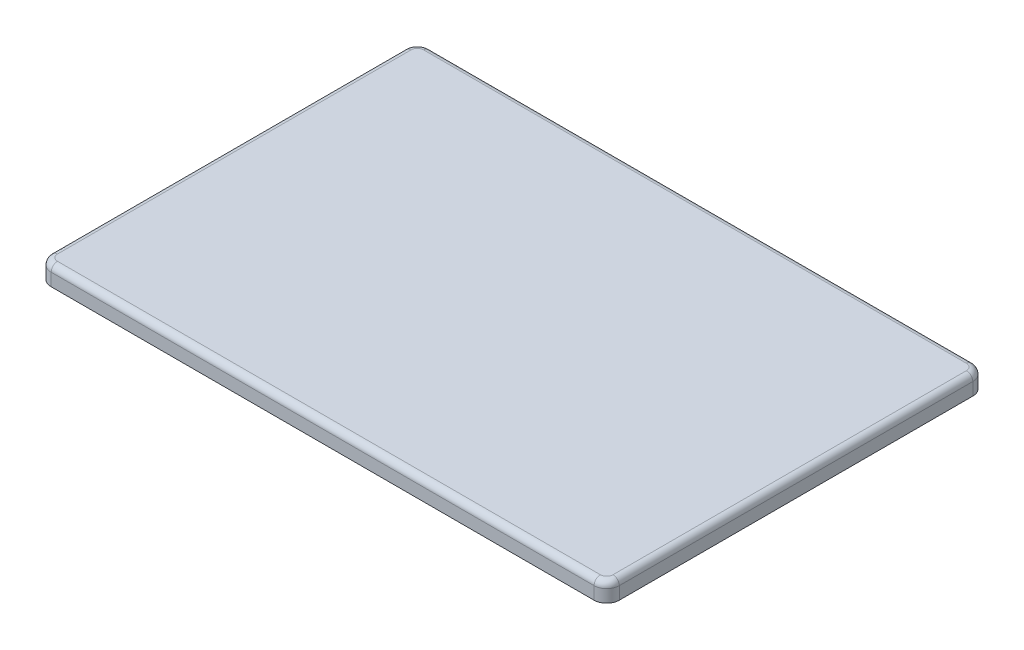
ISO-10303-21;
HEADER;
FILE_DESCRIPTION(('STEP AP214'),'2;1');
FILE_NAME('part.step','',(''),(''),'','','');
FILE_SCHEMA(('AUTOMOTIVE_DESIGN { 1 0 10303 214 1 1 1 1 }'));
ENDSEC;
DATA;
#1=APPLICATION_CONTEXT('core data for automotive mechanical design processes');
#2=APPLICATION_PROTOCOL_DEFINITION('international standard','automotive_design',2000,#1);
#3=PRODUCT_CONTEXT('',#1,'mechanical');
#4=PRODUCT('Part','Part','',(#3));
#5=PRODUCT_RELATED_PRODUCT_CATEGORY('part','',(#4));
#6=PRODUCT_DEFINITION_FORMATION('','',#4);
#7=PRODUCT_DEFINITION_CONTEXT('part definition',#1,'design');
#8=PRODUCT_DEFINITION('design','',#6,#7);
#9=PRODUCT_DEFINITION_SHAPE('','',#8);
#10=(LENGTH_UNIT() NAMED_UNIT(*) SI_UNIT(.MILLI.,.METRE.));
#11=(NAMED_UNIT(*) PLANE_ANGLE_UNIT() SI_UNIT($,.RADIAN.));
#12=(NAMED_UNIT(*) SI_UNIT($,.STERADIAN.) SOLID_ANGLE_UNIT());
#13=UNCERTAINTY_MEASURE_WITH_UNIT(LENGTH_MEASURE(1.E-05),#10,'distance_accuracy_value','');
#14=(GEOMETRIC_REPRESENTATION_CONTEXT(3) GLOBAL_UNCERTAINTY_ASSIGNED_CONTEXT((#13)) GLOBAL_UNIT_ASSIGNED_CONTEXT((#10,
#11,#12)) REPRESENTATION_CONTEXT('',''));
#15=CARTESIAN_POINT('',(0.,0.,0.));
#16=DIRECTION('',(0.,0.,1.));
#17=DIRECTION('',(1.,0.,0.));
#18=AXIS2_PLACEMENT_3D('',#15,#16,#17);
#19=CARTESIAN_POINT('',(-43.,-0.5,28.));
#20=DIRECTION('',(0.,-1.,0.));
#21=DIRECTION('',(0.,0.,-1.));
#22=AXIS2_PLACEMENT_3D('',#19,#20,#21);
#23=PLANE('',#22);
#24=DIRECTION('',(1.,0.,0.));
#25=VECTOR('',#24,1.);
#26=CARTESIAN_POINT('',(-2.45,-0.5,14.25));
#27=LINE('',#26,#25);
#28=CARTESIAN_POINT('',(-2.45,-0.5,14.25));
#29=VERTEX_POINT('',#28);
#30=CARTESIAN_POINT('',(2.45,-0.5,14.25));
#31=VERTEX_POINT('',#30);
#32=EDGE_CURVE('E426',#29,#31,#27,.T.);
#33=ORIENTED_EDGE('',*,*,#32,.F.);
#34=DIRECTION('',(0.,0.,-1.));
#35=VECTOR('',#34,1.);
#36=CARTESIAN_POINT('',(-2.45,-0.5,17.45));
#37=LINE('',#36,#35);
#38=CARTESIAN_POINT('',(-2.45,-0.5,17.45));
#39=VERTEX_POINT('',#38);
#40=EDGE_CURVE('E400',#39,#29,#37,.T.);
#41=ORIENTED_EDGE('',*,*,#40,.F.);
#42=DIRECTION('',(-1.,0.,0.));
#43=VECTOR('',#42,1.);
#44=CARTESIAN_POINT('',(-2.45,-0.5,17.45));
#45=LINE('',#44,#43);
#46=CARTESIAN_POINT('',(2.45,-0.5,17.45));
#47=VERTEX_POINT('',#46);
#48=EDGE_CURVE('E432',#47,#39,#45,.T.);
#49=ORIENTED_EDGE('',*,*,#48,.F.);
#50=DIRECTION('',(0.,0.,1.));
#51=VECTOR('',#50,1.);
#52=CARTESIAN_POINT('',(2.45,-0.5,17.45));
#53=LINE('',#52,#51);
#54=EDGE_CURVE('E429',#31,#47,#53,.T.);
#55=ORIENTED_EDGE('',*,*,#54,.F.);
#56=EDGE_LOOP('',(#33,#41,#49,#55));
#57=FACE_BOUND('',#56,.T.);
#58=DIRECTION('',(1.,0.,0.));
#59=VECTOR('',#58,1.);
#60=CARTESIAN_POINT('',(-32.45,-0.5,-17.45));
#61=LINE('',#60,#59);
#62=CARTESIAN_POINT('',(-32.45,-0.5,-17.45));
#63=VERTEX_POINT('',#62);
#64=CARTESIAN_POINT('',(-27.55,-0.5,-17.45));
#65=VERTEX_POINT('',#64);
#66=EDGE_CURVE('E466',#63,#65,#61,.T.);
#67=ORIENTED_EDGE('',*,*,#66,.F.);
#68=DIRECTION('',(0.,0.,-1.));
#69=VECTOR('',#68,1.);
#70=CARTESIAN_POINT('',(-32.45,-0.5,-14.25));
#71=LINE('',#70,#69);
#72=CARTESIAN_POINT('',(-32.45,-0.5,-14.25));
#73=VERTEX_POINT('',#72);
#74=EDGE_CURVE('E458',#73,#63,#71,.T.);
#75=ORIENTED_EDGE('',*,*,#74,.F.);
#76=DIRECTION('',(-1.,0.,0.));
#77=VECTOR('',#76,1.);
#78=CARTESIAN_POINT('',(-32.45,-0.5,-14.25));
#79=LINE('',#78,#77);
#80=CARTESIAN_POINT('',(-27.55,-0.5,-14.25));
#81=VERTEX_POINT('',#80);
#82=EDGE_CURVE('E472',#81,#73,#79,.T.);
#83=ORIENTED_EDGE('',*,*,#82,.F.);
#84=DIRECTION('',(0.,0.,1.));
#85=VECTOR('',#84,1.);
#86=CARTESIAN_POINT('',(-27.55,-0.5,-14.25));
#87=LINE('',#86,#85);
#88=EDGE_CURVE('E469',#65,#81,#87,.T.);
#89=ORIENTED_EDGE('',*,*,#88,.F.);
#90=EDGE_LOOP('',(#67,#75,#83,#89));
#91=FACE_BOUND('',#90,.T.);
#92=DIRECTION('',(1.,0.,0.));
#93=VECTOR('',#92,1.);
#94=CARTESIAN_POINT('',(-32.45,-0.5,14.25));
#95=LINE('',#94,#93);
#96=CARTESIAN_POINT('',(-32.45,-0.5,14.25));
#97=VERTEX_POINT('',#96);
#98=CARTESIAN_POINT('',(-27.55,-0.5,14.25));
#99=VERTEX_POINT('',#98);
#100=EDGE_CURVE('E506',#97,#99,#95,.T.);
#101=ORIENTED_EDGE('',*,*,#100,.F.);
#102=DIRECTION('',(0.,0.,-1.));
#103=VECTOR('',#102,1.);
#104=CARTESIAN_POINT('',(-32.45,-0.5,17.45));
#105=LINE('',#104,#103);
#106=CARTESIAN_POINT('',(-32.45,-0.5,17.45));
#107=VERTEX_POINT('',#106);
#108=EDGE_CURVE('E498',#107,#97,#105,.T.);
#109=ORIENTED_EDGE('',*,*,#108,.F.);
#110=DIRECTION('',(-1.,0.,0.));
#111=VECTOR('',#110,1.);
#112=CARTESIAN_POINT('',(-32.45,-0.5,17.45));
#113=LINE('',#112,#111);
#114=CARTESIAN_POINT('',(-27.55,-0.5,17.45));
#115=VERTEX_POINT('',#114);
#116=EDGE_CURVE('E512',#115,#107,#113,.T.);
#117=ORIENTED_EDGE('',*,*,#116,.F.);
#118=DIRECTION('',(0.,0.,1.));
#119=VECTOR('',#118,1.);
#120=CARTESIAN_POINT('',(-27.55,-0.5,17.45));
#121=LINE('',#120,#119);
#122=EDGE_CURVE('E509',#99,#115,#121,.T.);
#123=ORIENTED_EDGE('',*,*,#122,.F.);
#124=EDGE_LOOP('',(#101,#109,#117,#123));
#125=FACE_BOUND('',#124,.T.);
#126=CARTESIAN_POINT('',(-43.,-0.5,28.));
#127=DIRECTION('',(0.,-1.,0.));
#128=DIRECTION('',(0.,0.,-1.));
#129=AXIS2_PLACEMENT_3D('',#126,#127,#128);
#130=CIRCLE('',#129,0.200000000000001);
#131=CARTESIAN_POINT('',(-43.,-0.5,28.2));
#132=VERTEX_POINT('',#131);
#133=CARTESIAN_POINT('',(-43.2,-0.5,28.));
#134=VERTEX_POINT('',#133);
#135=EDGE_CURVE('E524',#132,#134,#130,.T.);
#136=ORIENTED_EDGE('',*,*,#135,.T.);
#137=DIRECTION('',(0.,0.,-1.));
#138=VECTOR('',#137,1.);
#139=CARTESIAN_POINT('',(-43.2,-0.5,28.));
#140=LINE('',#139,#138);
#141=CARTESIAN_POINT('',(-43.2,-0.5,-28.));
#142=VERTEX_POINT('',#141);
#143=EDGE_CURVE('E527',#134,#142,#140,.T.);
#144=ORIENTED_EDGE('',*,*,#143,.T.);
#145=CARTESIAN_POINT('',(-43.,-0.5,-28.));
#146=DIRECTION('',(0.,-1.,0.));
#147=DIRECTION('',(0.,0.,-1.));
#148=AXIS2_PLACEMENT_3D('',#145,#146,#147);
#149=CIRCLE('',#148,0.200000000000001);
#150=CARTESIAN_POINT('',(-43.,-0.5,-28.2));
#151=VERTEX_POINT('',#150);
#152=EDGE_CURVE('E531',#142,#151,#149,.T.);
#153=ORIENTED_EDGE('',*,*,#152,.T.);
#154=DIRECTION('',(1.,0.,0.));
#155=VECTOR('',#154,1.);
#156=CARTESIAN_POINT('',(-43.,-0.5,-28.2));
#157=LINE('',#156,#155);
#158=CARTESIAN_POINT('',(43.,-0.5,-28.2));
#159=VERTEX_POINT('',#158);
#160=EDGE_CURVE('E534',#151,#159,#157,.T.);
#161=ORIENTED_EDGE('',*,*,#160,.T.);
#162=CARTESIAN_POINT('',(43.,-0.5,-28.));
#163=DIRECTION('',(0.,-1.,0.));
#164=DIRECTION('',(0.,0.,-1.));
#165=AXIS2_PLACEMENT_3D('',#162,#163,#164);
#166=CIRCLE('',#165,0.200000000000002);
#167=CARTESIAN_POINT('',(43.2,-0.5,-28.));
#168=VERTEX_POINT('',#167);
#169=EDGE_CURVE('E537',#159,#168,#166,.T.);
#170=ORIENTED_EDGE('',*,*,#169,.T.);
#171=DIRECTION('',(0.,0.,1.));
#172=VECTOR('',#171,1.);
#173=CARTESIAN_POINT('',(43.2,-0.5,28.));
#174=LINE('',#173,#172);
#175=CARTESIAN_POINT('',(43.2,-0.5,28.));
#176=VERTEX_POINT('',#175);
#177=EDGE_CURVE('E540',#168,#176,#174,.T.);
#178=ORIENTED_EDGE('',*,*,#177,.T.);
#179=CARTESIAN_POINT('',(43.,-0.5,28.));
#180=DIRECTION('',(0.,-1.,0.));
#181=DIRECTION('',(0.,0.,-1.));
#182=AXIS2_PLACEMENT_3D('',#179,#180,#181);
#183=CIRCLE('',#182,0.199999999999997);
#184=CARTESIAN_POINT('',(43.,-0.5,28.2));
#185=VERTEX_POINT('',#184);
#186=EDGE_CURVE('E543',#176,#185,#183,.T.);
#187=ORIENTED_EDGE('',*,*,#186,.T.);
#188=DIRECTION('',(-1.,0.,0.));
#189=VECTOR('',#188,1.);
#190=CARTESIAN_POINT('',(-43.,-0.5,28.2));
#191=LINE('',#190,#189);
#192=EDGE_CURVE('E546',#185,#132,#191,.T.);
#193=ORIENTED_EDGE('',*,*,#192,.T.);
#194=EDGE_LOOP('',(#136,#144,#153,#161,#170,#178,#187,#193));
#195=FACE_BOUND('',#194,.T.);
#196=DIRECTION('',(1.,0.,0.));
#197=VECTOR('',#196,1.);
#198=CARTESIAN_POINT('',(27.55,-0.5,14.25));
#199=LINE('',#198,#197);
#200=CARTESIAN_POINT('',(27.55,-0.5,14.25));
#201=VERTEX_POINT('',#200);
#202=CARTESIAN_POINT('',(32.45,-0.5,14.25));
#203=VERTEX_POINT('',#202);
#204=EDGE_CURVE('E486',#201,#203,#199,.T.);
#205=ORIENTED_EDGE('',*,*,#204,.F.);
#206=DIRECTION('',(0.,0.,-1.));
#207=VECTOR('',#206,1.);
#208=CARTESIAN_POINT('',(27.55,-0.5,14.25));
#209=LINE('',#208,#207);
#210=CARTESIAN_POINT('',(27.55,-0.5,17.45));
#211=VERTEX_POINT('',#210);
#212=EDGE_CURVE('E478',#211,#201,#209,.T.);
#213=ORIENTED_EDGE('',*,*,#212,.F.);
#214=DIRECTION('',(-1.,0.,0.));
#215=VECTOR('',#214,1.);
#216=CARTESIAN_POINT('',(27.55,-0.5,17.45));
#217=LINE('',#216,#215);
#218=CARTESIAN_POINT('',(32.45,-0.5,17.45));
#219=VERTEX_POINT('',#218);
#220=EDGE_CURVE('E492',#219,#211,#217,.T.);
#221=ORIENTED_EDGE('',*,*,#220,.F.);
#222=DIRECTION('',(0.,0.,1.));
#223=VECTOR('',#222,1.);
#224=CARTESIAN_POINT('',(32.45,-0.5,14.25));
#225=LINE('',#224,#223);
#226=EDGE_CURVE('E489',#203,#219,#225,.T.);
#227=ORIENTED_EDGE('',*,*,#226,.F.);
#228=EDGE_LOOP('',(#205,#213,#221,#227));
#229=FACE_BOUND('',#228,.T.);
#230=DIRECTION('',(1.,0.,0.));
#231=VECTOR('',#230,1.);
#232=CARTESIAN_POINT('',(27.55,-0.5,-17.45));
#233=LINE('',#232,#231);
#234=CARTESIAN_POINT('',(27.55,-0.5,-17.45));
#235=VERTEX_POINT('',#234);
#236=CARTESIAN_POINT('',(32.45,-0.5,-17.45));
#237=VERTEX_POINT('',#236);
#238=EDGE_CURVE('E446',#235,#237,#233,.T.);
#239=ORIENTED_EDGE('',*,*,#238,.F.);
#240=DIRECTION('',(0.,0.,-1.));
#241=VECTOR('',#240,1.);
#242=CARTESIAN_POINT('',(27.55,-0.5,-14.25));
#243=LINE('',#242,#241);
#244=CARTESIAN_POINT('',(27.55,-0.5,-14.25));
#245=VERTEX_POINT('',#244);
#246=EDGE_CURVE('E438',#245,#235,#243,.T.);
#247=ORIENTED_EDGE('',*,*,#246,.F.);
#248=DIRECTION('',(-1.,0.,0.));
#249=VECTOR('',#248,1.);
#250=CARTESIAN_POINT('',(27.55,-0.5,-14.25));
#251=LINE('',#250,#249);
#252=CARTESIAN_POINT('',(32.45,-0.5,-14.25));
#253=VERTEX_POINT('',#252);
#254=EDGE_CURVE('E452',#253,#245,#251,.T.);
#255=ORIENTED_EDGE('',*,*,#254,.F.);
#256=DIRECTION('',(0.,0.,1.));
#257=VECTOR('',#256,1.);
#258=CARTESIAN_POINT('',(32.45,-0.5,-14.25));
#259=LINE('',#258,#257);
#260=EDGE_CURVE('E449',#237,#253,#259,.T.);
#261=ORIENTED_EDGE('',*,*,#260,.F.);
#262=EDGE_LOOP('',(#239,#247,#255,#261));
#263=FACE_BOUND('',#262,.T.);
#264=DIRECTION('',(1.,0.,0.));
#265=VECTOR('',#264,1.);
#266=CARTESIAN_POINT('',(-2.45,-0.5,-17.45));
#267=LINE('',#266,#265);
#268=CARTESIAN_POINT('',(-2.45,-0.5,-17.45));
#269=VERTEX_POINT('',#268);
#270=CARTESIAN_POINT('',(2.45,-0.5,-17.45));
#271=VERTEX_POINT('',#270);
#272=EDGE_CURVE('E394',#269,#271,#267,.T.);
#273=ORIENTED_EDGE('',*,*,#272,.F.);
#274=DIRECTION('',(0.,0.,-1.));
#275=VECTOR('',#274,1.);
#276=CARTESIAN_POINT('',(-2.45,-0.5,-14.25));
#277=LINE('',#276,#275);
#278=CARTESIAN_POINT('',(-2.45,-0.5,-14.25));
#279=VERTEX_POINT('',#278);
#280=EDGE_CURVE('E404',#279,#269,#277,.T.);
#281=ORIENTED_EDGE('',*,*,#280,.F.);
#282=DIRECTION('',(-1.,0.,0.));
#283=VECTOR('',#282,1.);
#284=CARTESIAN_POINT('',(-2.45,-0.5,-14.25));
#285=LINE('',#284,#283);
#286=CARTESIAN_POINT('',(2.45,-0.5,-14.25));
#287=VERTEX_POINT('',#286);
#288=EDGE_CURVE('E416',#287,#279,#285,.T.);
#289=ORIENTED_EDGE('',*,*,#288,.F.);
#290=DIRECTION('',(0.,0.,1.));
#291=VECTOR('',#290,1.);
#292=CARTESIAN_POINT('',(2.45,-0.5,-14.25));
#293=LINE('',#292,#291);
#294=EDGE_CURVE('E414',#271,#287,#293,.T.);
#295=ORIENTED_EDGE('',*,*,#294,.F.);
#296=EDGE_LOOP('',(#273,#281,#289,#295));
#297=FACE_BOUND('',#296,.T.);
#298=ADVANCED_FACE('F35',(#57,#91,#125,#195,#229,#263,#297),#23,.T.);
#299=CARTESIAN_POINT('',(-43.,1.5,-28.));
#300=DIRECTION('',(0.,-1.,0.));
#301=DIRECTION('',(0.,0.,-1.));
#302=AXIS2_PLACEMENT_3D('',#299,#300,#301);
#303=CYLINDRICAL_SURFACE('',#302,2.);
#304=DIRECTION('',(0.,-1.,0.));
#305=VECTOR('',#304,1.);
#306=CARTESIAN_POINT('',(-45.,1.5,-28.));
#307=LINE('',#306,#305);
#308=CARTESIAN_POINT('',(-45.,0.5,-28.));
#309=VERTEX_POINT('',#308);
#310=CARTESIAN_POINT('',(-45.,-1.5,-28.));
#311=VERTEX_POINT('',#310);
#312=EDGE_CURVE('E627',#309,#311,#307,.T.);
#313=ORIENTED_EDGE('',*,*,#312,.F.);
#314=CARTESIAN_POINT('',(-43.,0.5,-28.));
#315=DIRECTION('',(0.,1.,0.));
#316=DIRECTION('',(0.,0.,1.));
#317=AXIS2_PLACEMENT_3D('',#314,#315,#316);
#318=CIRCLE('',#317,2.);
#319=CARTESIAN_POINT('',(-43.,0.5,-30.));
#320=VERTEX_POINT('',#319);
#321=EDGE_CURVE('E651',#309,#320,#318,.F.);
#322=ORIENTED_EDGE('',*,*,#321,.T.);
#323=DIRECTION('',(0.,-1.,0.));
#324=VECTOR('',#323,1.);
#325=CARTESIAN_POINT('',(-43.,1.5,-30.));
#326=LINE('',#325,#324);
#327=CARTESIAN_POINT('',(-43.,-1.5,-30.));
#328=VERTEX_POINT('',#327);
#329=EDGE_CURVE('E613',#320,#328,#326,.T.);
#330=ORIENTED_EDGE('',*,*,#329,.T.);
#331=CARTESIAN_POINT('',(-43.,-1.5,-28.));
#332=DIRECTION('',(0.,1.,0.));
#333=DIRECTION('',(0.,0.,1.));
#334=AXIS2_PLACEMENT_3D('',#331,#332,#333);
#335=CIRCLE('',#334,2.);
#336=EDGE_CURVE('E588',#328,#311,#335,.T.);
#337=ORIENTED_EDGE('',*,*,#336,.T.);
#338=EDGE_LOOP('',(#313,#322,#330,#337));
#339=FACE_BOUND('',#338,.T.);
#340=ADVANCED_FACE('F882',(#339),#303,.T.);
#341=CARTESIAN_POINT('',(-45.,1.5,28.));
#342=DIRECTION('',(1.,0.,0.));
#343=DIRECTION('',(0.,0.,-1.));
#344=AXIS2_PLACEMENT_3D('',#341,#342,#343);
#345=PLANE('',#344);
#346=DIRECTION('',(0.,-1.,0.));
#347=VECTOR('',#346,1.);
#348=CARTESIAN_POINT('',(-45.,1.5,28.));
#349=LINE('',#348,#347);
#350=CARTESIAN_POINT('',(-45.,0.5,28.));
#351=VERTEX_POINT('',#350);
#352=CARTESIAN_POINT('',(-45.,-1.5,28.));
#353=VERTEX_POINT('',#352);
#354=EDGE_CURVE('E625',#351,#353,#349,.T.);
#355=ORIENTED_EDGE('',*,*,#354,.F.);
#356=DIRECTION('',(0.,0.,1.));
#357=VECTOR('',#356,1.);
#358=CARTESIAN_POINT('',(-45.,0.5,-28.));
#359=LINE('',#358,#357);
#360=EDGE_CURVE('E649',#351,#309,#359,.F.);
#361=ORIENTED_EDGE('',*,*,#360,.T.);
#362=ORIENTED_EDGE('',*,*,#312,.T.);
#363=DIRECTION('',(0.,0.,1.));
#364=VECTOR('',#363,1.);
#365=CARTESIAN_POINT('',(-45.,-1.5,28.));
#366=LINE('',#365,#364);
#367=EDGE_CURVE('E591',#311,#353,#366,.T.);
#368=ORIENTED_EDGE('',*,*,#367,.T.);
#369=EDGE_LOOP('',(#355,#361,#362,#368));
#370=FACE_BOUND('',#369,.T.);
#371=ADVANCED_FACE('F888',(#370),#345,.F.);
#372=CARTESIAN_POINT('',(-43.,1.5,28.));
#373=DIRECTION('',(0.,-1.,0.));
#374=DIRECTION('',(0.,0.,-1.));
#375=AXIS2_PLACEMENT_3D('',#372,#373,#374);
#376=CYLINDRICAL_SURFACE('',#375,2.);
#377=DIRECTION('',(0.,-1.,0.));
#378=VECTOR('',#377,1.);
#379=CARTESIAN_POINT('',(-43.,1.5,30.));
#380=LINE('',#379,#378);
#381=CARTESIAN_POINT('',(-43.,0.5,30.));
#382=VERTEX_POINT('',#381);
#383=CARTESIAN_POINT('',(-43.,-1.5,30.));
#384=VERTEX_POINT('',#383);
#385=EDGE_CURVE('E623',#382,#384,#380,.T.);
#386=ORIENTED_EDGE('',*,*,#385,.F.);
#387=CARTESIAN_POINT('',(-43.,0.5,28.));
#388=DIRECTION('',(0.,1.,0.));
#389=DIRECTION('',(0.,0.,1.));
#390=AXIS2_PLACEMENT_3D('',#387,#388,#389);
#391=CIRCLE('',#390,2.);
#392=EDGE_CURVE('E646',#382,#351,#391,.F.);
#393=ORIENTED_EDGE('',*,*,#392,.T.);
#394=ORIENTED_EDGE('',*,*,#354,.T.);
#395=CARTESIAN_POINT('',(-43.,-1.5,28.));
#396=DIRECTION('',(0.,1.,0.));
#397=DIRECTION('',(0.,0.,1.));
#398=AXIS2_PLACEMENT_3D('',#395,#396,#397);
#399=CIRCLE('',#398,2.);
#400=EDGE_CURVE('E595',#353,#384,#399,.T.);
#401=ORIENTED_EDGE('',*,*,#400,.T.);
#402=EDGE_LOOP('',(#386,#393,#394,#401));
#403=FACE_BOUND('',#402,.T.);
#404=ADVANCED_FACE('F958',(#403),#376,.T.);
#405=CARTESIAN_POINT('',(-43.,1.5,30.));
#406=DIRECTION('',(0.,0.,-1.));
#407=DIRECTION('',(-1.,0.,0.));
#408=AXIS2_PLACEMENT_3D('',#405,#406,#407);
#409=PLANE('',#408);
#410=DIRECTION('',(0.,-1.,0.));
#411=VECTOR('',#410,1.);
#412=CARTESIAN_POINT('',(43.,1.5,30.));
#413=LINE('',#412,#411);
#414=CARTESIAN_POINT('',(43.,0.5,30.));
#415=VERTEX_POINT('',#414);
#416=CARTESIAN_POINT('',(43.,-1.5,30.));
#417=VERTEX_POINT('',#416);
#418=EDGE_CURVE('E621',#415,#417,#413,.T.);
#419=ORIENTED_EDGE('',*,*,#418,.F.);
#420=DIRECTION('',(1.,0.,0.));
#421=VECTOR('',#420,1.);
#422=CARTESIAN_POINT('',(-43.,0.5,30.));
#423=LINE('',#422,#421);
#424=EDGE_CURVE('E661',#415,#382,#423,.F.);
#425=ORIENTED_EDGE('',*,*,#424,.T.);
#426=ORIENTED_EDGE('',*,*,#385,.T.);
#427=DIRECTION('',(1.,0.,0.));
#428=VECTOR('',#427,1.);
#429=CARTESIAN_POINT('',(-43.,-1.5,30.));
#430=LINE('',#429,#428);
#431=EDGE_CURVE('E598',#384,#417,#430,.T.);
#432=ORIENTED_EDGE('',*,*,#431,.T.);
#433=EDGE_LOOP('',(#419,#425,#426,#432));
#434=FACE_BOUND('',#433,.T.);
#435=ADVANCED_FACE('F954',(#434),#409,.F.);
#436=CARTESIAN_POINT('',(43.,1.5,28.));
#437=DIRECTION('',(0.,-1.,0.));
#438=DIRECTION('',(0.,0.,-1.));
#439=AXIS2_PLACEMENT_3D('',#436,#437,#438);
#440=CYLINDRICAL_SURFACE('',#439,2.);
#441=DIRECTION('',(0.,-1.,0.));
#442=VECTOR('',#441,1.);
#443=CARTESIAN_POINT('',(45.,1.5,28.));
#444=LINE('',#443,#442);
#445=CARTESIAN_POINT('',(45.,0.5,28.));
#446=VERTEX_POINT('',#445);
#447=CARTESIAN_POINT('',(45.,-1.5,28.));
#448=VERTEX_POINT('',#447);
#449=EDGE_CURVE('E619',#446,#448,#444,.T.);
#450=ORIENTED_EDGE('',*,*,#449,.F.);
#451=CARTESIAN_POINT('',(43.,0.5,28.));
#452=DIRECTION('',(0.,1.,0.));
#453=DIRECTION('',(0.,0.,1.));
#454=AXIS2_PLACEMENT_3D('',#451,#452,#453);
#455=CIRCLE('',#454,2.);
#456=EDGE_CURVE('E659',#446,#415,#455,.F.);
#457=ORIENTED_EDGE('',*,*,#456,.T.);
#458=ORIENTED_EDGE('',*,*,#418,.T.);
#459=CARTESIAN_POINT('',(43.,-1.5,28.));
#460=DIRECTION('',(0.,1.,0.));
#461=DIRECTION('',(0.,0.,1.));
#462=AXIS2_PLACEMENT_3D('',#459,#460,#461);
#463=CIRCLE('',#462,2.);
#464=EDGE_CURVE('E601',#417,#448,#463,.T.);
#465=ORIENTED_EDGE('',*,*,#464,.T.);
#466=EDGE_LOOP('',(#450,#457,#458,#465));
#467=FACE_BOUND('',#466,.T.);
#468=ADVANCED_FACE('F950',(#467),#440,.T.);
#469=CARTESIAN_POINT('',(45.,1.5,28.));
#470=DIRECTION('',(-1.,0.,0.));
#471=DIRECTION('',(0.,0.,1.));
#472=AXIS2_PLACEMENT_3D('',#469,#470,#471);
#473=PLANE('',#472);
#474=DIRECTION('',(0.,-1.,0.));
#475=VECTOR('',#474,1.);
#476=CARTESIAN_POINT('',(45.,1.5,-28.));
#477=LINE('',#476,#475);
#478=CARTESIAN_POINT('',(45.,0.5,-28.));
#479=VERTEX_POINT('',#478);
#480=CARTESIAN_POINT('',(45.,-1.5,-28.));
#481=VERTEX_POINT('',#480);
#482=EDGE_CURVE('E617',#479,#481,#477,.T.);
#483=ORIENTED_EDGE('',*,*,#482,.F.);
#484=DIRECTION('',(0.,0.,-1.));
#485=VECTOR('',#484,1.);
#486=CARTESIAN_POINT('',(45.,0.5,28.));
#487=LINE('',#486,#485);
#488=EDGE_CURVE('E657',#479,#446,#487,.F.);
#489=ORIENTED_EDGE('',*,*,#488,.T.);
#490=ORIENTED_EDGE('',*,*,#449,.T.);
#491=DIRECTION('',(0.,0.,-1.));
#492=VECTOR('',#491,1.);
#493=CARTESIAN_POINT('',(45.,-1.5,28.));
#494=LINE('',#493,#492);
#495=EDGE_CURVE('E604',#448,#481,#494,.T.);
#496=ORIENTED_EDGE('',*,*,#495,.T.);
#497=EDGE_LOOP('',(#483,#489,#490,#496));
#498=FACE_BOUND('',#497,.T.);
#499=ADVANCED_FACE('F946',(#498),#473,.F.);
#500=CARTESIAN_POINT('',(43.,1.5,-28.));
#501=DIRECTION('',(0.,-1.,0.));
#502=DIRECTION('',(0.,0.,-1.));
#503=AXIS2_PLACEMENT_3D('',#500,#501,#502);
#504=CYLINDRICAL_SURFACE('',#503,2.);
#505=DIRECTION('',(0.,-1.,0.));
#506=VECTOR('',#505,1.);
#507=CARTESIAN_POINT('',(43.,1.5,-30.));
#508=LINE('',#507,#506);
#509=CARTESIAN_POINT('',(43.,0.5,-30.));
#510=VERTEX_POINT('',#509);
#511=CARTESIAN_POINT('',(43.,-1.5,-30.));
#512=VERTEX_POINT('',#511);
#513=EDGE_CURVE('E615',#510,#512,#508,.T.);
#514=ORIENTED_EDGE('',*,*,#513,.F.);
#515=CARTESIAN_POINT('',(43.,0.5,-28.));
#516=DIRECTION('',(0.,1.,0.));
#517=DIRECTION('',(0.,0.,1.));
#518=AXIS2_PLACEMENT_3D('',#515,#516,#517);
#519=CIRCLE('',#518,2.);
#520=EDGE_CURVE('E655',#510,#479,#519,.F.);
#521=ORIENTED_EDGE('',*,*,#520,.T.);
#522=ORIENTED_EDGE('',*,*,#482,.T.);
#523=CARTESIAN_POINT('',(43.,-1.5,-28.));
#524=DIRECTION('',(0.,1.,0.));
#525=DIRECTION('',(0.,0.,1.));
#526=AXIS2_PLACEMENT_3D('',#523,#524,#525);
#527=CIRCLE('',#526,2.);
#528=EDGE_CURVE('E607',#481,#512,#527,.T.);
#529=ORIENTED_EDGE('',*,*,#528,.T.);
#530=EDGE_LOOP('',(#514,#521,#522,#529));
#531=FACE_BOUND('',#530,.T.);
#532=ADVANCED_FACE('F942',(#531),#504,.T.);
#533=CARTESIAN_POINT('',(-43.,1.5,-30.));
#534=DIRECTION('',(0.,0.,1.));
#535=DIRECTION('',(1.,0.,0.));
#536=AXIS2_PLACEMENT_3D('',#533,#534,#535);
#537=PLANE('',#536);
#538=ORIENTED_EDGE('',*,*,#329,.F.);
#539=DIRECTION('',(-1.,0.,0.));
#540=VECTOR('',#539,1.);
#541=CARTESIAN_POINT('',(43.,0.5,-30.));
#542=LINE('',#541,#540);
#543=EDGE_CURVE('E653',#320,#510,#542,.F.);
#544=ORIENTED_EDGE('',*,*,#543,.T.);
#545=ORIENTED_EDGE('',*,*,#513,.T.);
#546=DIRECTION('',(-1.,0.,0.));
#547=VECTOR('',#546,1.);
#548=CARTESIAN_POINT('',(-43.,-1.5,-30.));
#549=LINE('',#548,#547);
#550=EDGE_CURVE('E610',#512,#328,#549,.T.);
#551=ORIENTED_EDGE('',*,*,#550,.T.);
#552=EDGE_LOOP('',(#538,#544,#545,#551));
#553=FACE_BOUND('',#552,.T.);
#554=ADVANCED_FACE('F934',(#553),#537,.F.);
#555=CARTESIAN_POINT('',(-43.,1.5,-28.));
#556=DIRECTION('',(0.,1.,0.));
#557=DIRECTION('',(0.,0.,1.));
#558=AXIS2_PLACEMENT_3D('',#555,#556,#557);
#559=PLANE('',#558);
#560=DIRECTION('',(0.,0.,1.));
#561=VECTOR('',#560,1.);
#562=CARTESIAN_POINT('',(-44.,1.5,28.));
#563=LINE('',#562,#561);
#564=CARTESIAN_POINT('',(-44.,1.5,-28.));
#565=VERTEX_POINT('',#564);
#566=CARTESIAN_POINT('',(-44.,1.5,28.));
#567=VERTEX_POINT('',#566);
#568=EDGE_CURVE('E641',#565,#567,#563,.T.);
#569=ORIENTED_EDGE('',*,*,#568,.T.);
#570=CARTESIAN_POINT('',(-43.,1.5,28.));
#571=DIRECTION('',(0.,1.,0.));
#572=DIRECTION('',(0.,0.,1.));
#573=AXIS2_PLACEMENT_3D('',#570,#571,#572);
#574=CIRCLE('',#573,1.);
#575=CARTESIAN_POINT('',(-43.,1.5,29.));
#576=VERTEX_POINT('',#575);
#577=EDGE_CURVE('E643',#567,#576,#574,.T.);
#578=ORIENTED_EDGE('',*,*,#577,.T.);
#579=DIRECTION('',(1.,0.,0.));
#580=VECTOR('',#579,1.);
#581=CARTESIAN_POINT('',(43.,1.5,29.));
#582=LINE('',#581,#580);
#583=CARTESIAN_POINT('',(43.,1.5,29.));
#584=VERTEX_POINT('',#583);
#585=EDGE_CURVE('E629',#576,#584,#582,.T.);
#586=ORIENTED_EDGE('',*,*,#585,.T.);
#587=CARTESIAN_POINT('',(43.,1.5,28.));
#588=DIRECTION('',(0.,1.,0.));
#589=DIRECTION('',(0.,0.,1.));
#590=AXIS2_PLACEMENT_3D('',#587,#588,#589);
#591=CIRCLE('',#590,1.);
#592=CARTESIAN_POINT('',(44.,1.5,28.));
#593=VERTEX_POINT('',#592);
#594=EDGE_CURVE('E631',#584,#593,#591,.T.);
#595=ORIENTED_EDGE('',*,*,#594,.T.);
#596=DIRECTION('',(0.,0.,-1.));
#597=VECTOR('',#596,1.);
#598=CARTESIAN_POINT('',(44.,1.5,-28.));
#599=LINE('',#598,#597);
#600=CARTESIAN_POINT('',(44.,1.5,-28.));
#601=VERTEX_POINT('',#600);
#602=EDGE_CURVE('E633',#593,#601,#599,.T.);
#603=ORIENTED_EDGE('',*,*,#602,.T.);
#604=CARTESIAN_POINT('',(43.,1.5,-28.));
#605=DIRECTION('',(0.,1.,0.));
#606=DIRECTION('',(0.,0.,1.));
#607=AXIS2_PLACEMENT_3D('',#604,#605,#606);
#608=CIRCLE('',#607,1.);
#609=CARTESIAN_POINT('',(43.,1.5,-29.));
#610=VERTEX_POINT('',#609);
#611=EDGE_CURVE('E635',#601,#610,#608,.T.);
#612=ORIENTED_EDGE('',*,*,#611,.T.);
#613=DIRECTION('',(-1.,0.,0.));
#614=VECTOR('',#613,1.);
#615=CARTESIAN_POINT('',(-43.,1.5,-29.));
#616=LINE('',#615,#614);
#617=CARTESIAN_POINT('',(-43.,1.5,-29.));
#618=VERTEX_POINT('',#617);
#619=EDGE_CURVE('E637',#610,#618,#616,.T.);
#620=ORIENTED_EDGE('',*,*,#619,.T.);
#621=CARTESIAN_POINT('',(-43.,1.5,-28.));
#622=DIRECTION('',(0.,1.,0.));
#623=DIRECTION('',(0.,0.,1.));
#624=AXIS2_PLACEMENT_3D('',#621,#622,#623);
#625=CIRCLE('',#624,1.);
#626=EDGE_CURVE('E639',#618,#565,#625,.T.);
#627=ORIENTED_EDGE('',*,*,#626,.T.);
#628=EDGE_LOOP('',(#569,#578,#586,#595,#603,#612,#620,#627));
#629=FACE_BOUND('',#628,.T.);
#630=ADVANCED_FACE('F930',(#629),#559,.T.);
#631=CARTESIAN_POINT('',(-43.,-1.5,-28.));
#632=DIRECTION('',(0.,1.,0.));
#633=DIRECTION('',(0.,0.,1.));
#634=AXIS2_PLACEMENT_3D('',#631,#632,#633);
#635=PLANE('',#634);
#636=DIRECTION('',(0.,0.,-1.));
#637=VECTOR('',#636,1.);
#638=CARTESIAN_POINT('',(-43.2,-1.5,28.));
#639=LINE('',#638,#637);
#640=CARTESIAN_POINT('',(-43.2,-1.5,28.));
#641=VERTEX_POINT('',#640);
#642=CARTESIAN_POINT('',(-43.2,-1.5,-28.));
#643=VERTEX_POINT('',#642);
#644=EDGE_CURVE('E551',#641,#643,#639,.T.);
#645=ORIENTED_EDGE('',*,*,#644,.F.);
#646=CARTESIAN_POINT('',(-43.,-1.5,28.));
#647=DIRECTION('',(0.,-1.,0.));
#648=DIRECTION('',(0.,0.,-1.));
#649=AXIS2_PLACEMENT_3D('',#646,#647,#648);
#650=CIRCLE('',#649,0.200000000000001);
#651=CARTESIAN_POINT('',(-43.,-1.5,28.2));
#652=VERTEX_POINT('',#651);
#653=EDGE_CURVE('E518',#652,#641,#650,.T.);
#654=ORIENTED_EDGE('',*,*,#653,.F.);
#655=DIRECTION('',(-1.,0.,0.));
#656=VECTOR('',#655,1.);
#657=CARTESIAN_POINT('',(-43.,-1.5,28.2));
#658=LINE('',#657,#656);
#659=CARTESIAN_POINT('',(43.,-1.5,28.2));
#660=VERTEX_POINT('',#659);
#661=EDGE_CURVE('E528',#660,#652,#658,.T.);
#662=ORIENTED_EDGE('',*,*,#661,.F.);
#663=CARTESIAN_POINT('',(43.,-1.5,28.));
#664=DIRECTION('',(0.,-1.,0.));
#665=DIRECTION('',(0.,0.,-1.));
#666=AXIS2_PLACEMENT_3D('',#663,#664,#665);
#667=CIRCLE('',#666,0.199999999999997);
#668=CARTESIAN_POINT('',(43.2,-1.5,28.));
#669=VERTEX_POINT('',#668);
#670=EDGE_CURVE('E566',#669,#660,#667,.T.);
#671=ORIENTED_EDGE('',*,*,#670,.F.);
#672=DIRECTION('',(0.,0.,1.));
#673=VECTOR('',#672,1.);
#674=CARTESIAN_POINT('',(43.2,-1.5,28.));
#675=LINE('',#674,#673);
#676=CARTESIAN_POINT('',(43.2,-1.5,-28.));
#677=VERTEX_POINT('',#676);
#678=EDGE_CURVE('E563',#677,#669,#675,.T.);
#679=ORIENTED_EDGE('',*,*,#678,.F.);
#680=CARTESIAN_POINT('',(43.,-1.5,-28.));
#681=DIRECTION('',(0.,-1.,0.));
#682=DIRECTION('',(0.,0.,-1.));
#683=AXIS2_PLACEMENT_3D('',#680,#681,#682);
#684=CIRCLE('',#683,0.200000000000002);
#685=CARTESIAN_POINT('',(43.,-1.5,-28.2));
#686=VERTEX_POINT('',#685);
#687=EDGE_CURVE('E560',#686,#677,#684,.T.);
#688=ORIENTED_EDGE('',*,*,#687,.F.);
#689=DIRECTION('',(1.,0.,0.));
#690=VECTOR('',#689,1.);
#691=CARTESIAN_POINT('',(-43.,-1.5,-28.2));
#692=LINE('',#691,#690);
#693=CARTESIAN_POINT('',(-43.,-1.5,-28.2));
#694=VERTEX_POINT('',#693);
#695=EDGE_CURVE('E557',#694,#686,#692,.T.);
#696=ORIENTED_EDGE('',*,*,#695,.F.);
#697=CARTESIAN_POINT('',(-43.,-1.5,-28.));
#698=DIRECTION('',(0.,-1.,0.));
#699=DIRECTION('',(0.,0.,-1.));
#700=AXIS2_PLACEMENT_3D('',#697,#698,#699);
#701=CIRCLE('',#700,0.200000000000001);
#702=EDGE_CURVE('E554',#643,#694,#701,.T.);
#703=ORIENTED_EDGE('',*,*,#702,.F.);
#704=EDGE_LOOP('',(#645,#654,#662,#671,#679,#688,#696,#703));
#705=FACE_BOUND('',#704,.T.);
#706=ORIENTED_EDGE('',*,*,#336,.F.);
#707=ORIENTED_EDGE('',*,*,#550,.F.);
#708=ORIENTED_EDGE('',*,*,#528,.F.);
#709=ORIENTED_EDGE('',*,*,#495,.F.);
#710=ORIENTED_EDGE('',*,*,#464,.F.);
#711=ORIENTED_EDGE('',*,*,#431,.F.);
#712=ORIENTED_EDGE('',*,*,#400,.F.);
#713=ORIENTED_EDGE('',*,*,#367,.F.);
#714=EDGE_LOOP('',(#706,#707,#708,#709,#710,#711,#712,#713));
#715=FACE_BOUND('',#714,.T.);
#716=ADVANCED_FACE('F933',(#705,#715),#635,.F.);
#717=CARTESIAN_POINT('',(43.,0.5,-28.));
#718=DIRECTION('',(0.,1.,0.));
#719=DIRECTION('',(0.,0.,1.));
#720=AXIS2_PLACEMENT_3D('',#717,#718,#719);
#721=TOROIDAL_SURFACE('',#720,1.,1.);
#722=CARTESIAN_POINT('',(44.,0.5,-28.));
#723=DIRECTION('',(0.,0.,1.));
#724=DIRECTION('',(1.,0.,0.));
#725=AXIS2_PLACEMENT_3D('',#722,#723,#724);
#726=CIRCLE('',#725,1.);
#727=EDGE_CURVE('E679',#479,#601,#726,.T.);
#728=ORIENTED_EDGE('',*,*,#727,.F.);
#729=ORIENTED_EDGE('',*,*,#520,.F.);
#730=CARTESIAN_POINT('',(43.,0.5,-29.));
#731=DIRECTION('',(-1.,0.,0.));
#732=DIRECTION('',(0.,0.,1.));
#733=AXIS2_PLACEMENT_3D('',#730,#731,#732);
#734=CIRCLE('',#733,1.);
#735=EDGE_CURVE('E592',#610,#510,#734,.T.);
#736=ORIENTED_EDGE('',*,*,#735,.F.);
#737=ORIENTED_EDGE('',*,*,#611,.F.);
#738=EDGE_LOOP('',(#728,#729,#736,#737));
#739=FACE_BOUND('',#738,.T.);
#740=ADVANCED_FACE('F938',(#739),#721,.T.);
#741=CARTESIAN_POINT('',(-43.,0.5,-29.));
#742=DIRECTION('',(1.,0.,0.));
#743=DIRECTION('',(0.,0.,-1.));
#744=AXIS2_PLACEMENT_3D('',#741,#742,#743);
#745=CYLINDRICAL_SURFACE('',#744,1.);
#746=ORIENTED_EDGE('',*,*,#735,.T.);
#747=ORIENTED_EDGE('',*,*,#543,.F.);
#748=CARTESIAN_POINT('',(-43.,0.5,-29.));
#749=DIRECTION('',(-1.,0.,0.));
#750=DIRECTION('',(0.,0.,1.));
#751=AXIS2_PLACEMENT_3D('',#748,#749,#750);
#752=CIRCLE('',#751,1.);
#753=EDGE_CURVE('E676',#618,#320,#752,.T.);
#754=ORIENTED_EDGE('',*,*,#753,.F.);
#755=ORIENTED_EDGE('',*,*,#619,.F.);
#756=EDGE_LOOP('',(#746,#747,#754,#755));
#757=FACE_BOUND('',#756,.T.);
#758=ADVANCED_FACE('F988',(#757),#745,.T.);
#759=CARTESIAN_POINT('',(44.,0.5,-28.));
#760=DIRECTION('',(0.,0.,1.));
#761=DIRECTION('',(1.,0.,0.));
#762=AXIS2_PLACEMENT_3D('',#759,#760,#761);
#763=CYLINDRICAL_SURFACE('',#762,1.);
#764=ORIENTED_EDGE('',*,*,#727,.T.);
#765=ORIENTED_EDGE('',*,*,#602,.F.);
#766=CARTESIAN_POINT('',(44.,0.5,28.));
#767=DIRECTION('',(0.,0.,1.));
#768=DIRECTION('',(1.,0.,0.));
#769=AXIS2_PLACEMENT_3D('',#766,#767,#768);
#770=CIRCLE('',#769,1.);
#771=EDGE_CURVE('E673',#446,#593,#770,.T.);
#772=ORIENTED_EDGE('',*,*,#771,.F.);
#773=ORIENTED_EDGE('',*,*,#488,.F.);
#774=EDGE_LOOP('',(#764,#765,#772,#773));
#775=FACE_BOUND('',#774,.T.);
#776=ADVANCED_FACE('F984',(#775),#763,.T.);
#777=CARTESIAN_POINT('',(-43.,0.5,-28.));
#778=DIRECTION('',(0.,1.,0.));
#779=DIRECTION('',(0.,0.,1.));
#780=AXIS2_PLACEMENT_3D('',#777,#778,#779);
#781=TOROIDAL_SURFACE('',#780,1.,1.);
#782=ORIENTED_EDGE('',*,*,#753,.T.);
#783=ORIENTED_EDGE('',*,*,#321,.F.);
#784=CARTESIAN_POINT('',(-44.,0.5,-28.));
#785=DIRECTION('',(0.,0.,1.));
#786=DIRECTION('',(1.,0.,0.));
#787=AXIS2_PLACEMENT_3D('',#784,#785,#786);
#788=CIRCLE('',#787,1.);
#789=EDGE_CURVE('E670',#565,#309,#788,.T.);
#790=ORIENTED_EDGE('',*,*,#789,.F.);
#791=ORIENTED_EDGE('',*,*,#626,.F.);
#792=EDGE_LOOP('',(#782,#783,#790,#791));
#793=FACE_BOUND('',#792,.T.);
#794=ADVANCED_FACE('F980',(#793),#781,.T.);
#795=CARTESIAN_POINT('',(43.,0.5,28.));
#796=DIRECTION('',(0.,1.,0.));
#797=DIRECTION('',(0.,0.,1.));
#798=AXIS2_PLACEMENT_3D('',#795,#796,#797);
#799=TOROIDAL_SURFACE('',#798,1.,1.);
#800=ORIENTED_EDGE('',*,*,#771,.T.);
#801=ORIENTED_EDGE('',*,*,#594,.F.);
#802=CARTESIAN_POINT('',(43.,0.5,29.));
#803=DIRECTION('',(-1.,0.,0.));
#804=DIRECTION('',(0.,0.,1.));
#805=AXIS2_PLACEMENT_3D('',#802,#803,#804);
#806=CIRCLE('',#805,1.);
#807=EDGE_CURVE('E667',#415,#584,#806,.T.);
#808=ORIENTED_EDGE('',*,*,#807,.F.);
#809=ORIENTED_EDGE('',*,*,#456,.F.);
#810=EDGE_LOOP('',(#800,#801,#808,#809));
#811=FACE_BOUND('',#810,.T.);
#812=ADVANCED_FACE('F976',(#811),#799,.T.);
#813=CARTESIAN_POINT('',(-44.,0.5,-28.));
#814=DIRECTION('',(0.,0.,-1.));
#815=DIRECTION('',(-1.,0.,0.));
#816=AXIS2_PLACEMENT_3D('',#813,#814,#815);
#817=CYLINDRICAL_SURFACE('',#816,1.);
#818=ORIENTED_EDGE('',*,*,#789,.T.);
#819=ORIENTED_EDGE('',*,*,#360,.F.);
#820=CARTESIAN_POINT('',(-44.,0.5,28.));
#821=DIRECTION('',(0.,0.,1.));
#822=DIRECTION('',(1.,0.,0.));
#823=AXIS2_PLACEMENT_3D('',#820,#821,#822);
#824=CIRCLE('',#823,1.);
#825=EDGE_CURVE('E665',#567,#351,#824,.T.);
#826=ORIENTED_EDGE('',*,*,#825,.F.);
#827=ORIENTED_EDGE('',*,*,#568,.F.);
#828=EDGE_LOOP('',(#818,#819,#826,#827));
#829=FACE_BOUND('',#828,.T.);
#830=ADVANCED_FACE('F972',(#829),#817,.T.);
#831=CARTESIAN_POINT('',(-43.,0.5,29.));
#832=DIRECTION('',(-1.,0.,0.));
#833=DIRECTION('',(0.,0.,1.));
#834=AXIS2_PLACEMENT_3D('',#831,#832,#833);
#835=CYLINDRICAL_SURFACE('',#834,1.);
#836=ORIENTED_EDGE('',*,*,#807,.T.);
#837=ORIENTED_EDGE('',*,*,#585,.F.);
#838=CARTESIAN_POINT('',(-43.,0.5,29.));
#839=DIRECTION('',(-1.,0.,0.));
#840=DIRECTION('',(0.,0.,1.));
#841=AXIS2_PLACEMENT_3D('',#838,#839,#840);
#842=CIRCLE('',#841,1.);
#843=EDGE_CURVE('E573',#382,#576,#842,.T.);
#844=ORIENTED_EDGE('',*,*,#843,.F.);
#845=ORIENTED_EDGE('',*,*,#424,.F.);
#846=EDGE_LOOP('',(#836,#837,#844,#845));
#847=FACE_BOUND('',#846,.T.);
#848=ADVANCED_FACE('F968',(#847),#835,.T.);
#849=CARTESIAN_POINT('',(-43.,0.5,28.));
#850=DIRECTION('',(0.,1.,0.));
#851=DIRECTION('',(0.,0.,1.));
#852=AXIS2_PLACEMENT_3D('',#849,#850,#851);
#853=DEGENERATE_TOROIDAL_SURFACE('',#852,1.,1.,.T.);
#854=ORIENTED_EDGE('',*,*,#825,.T.);
#855=ORIENTED_EDGE('',*,*,#392,.F.);
#856=ORIENTED_EDGE('',*,*,#843,.T.);
#857=ORIENTED_EDGE('',*,*,#577,.F.);
#858=EDGE_LOOP('',(#854,#855,#856,#857));
#859=FACE_BOUND('',#858,.T.);
#860=ADVANCED_FACE('F928',(#859),#853,.T.);
#861=CARTESIAN_POINT('',(-43.,-0.5,28.));
#862=DIRECTION('',(0.,-1.,0.));
#863=DIRECTION('',(0.,0.,-1.));
#864=AXIS2_PLACEMENT_3D('',#861,#862,#863);
#865=CYLINDRICAL_SURFACE('',#864,0.200000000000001);
#866=ORIENTED_EDGE('',*,*,#653,.T.);
#867=DIRECTION('',(0.,-1.,0.));
#868=VECTOR('',#867,1.);
#869=CARTESIAN_POINT('',(-43.2,-0.5,28.));
#870=LINE('',#869,#868);
#871=EDGE_CURVE('E549',#134,#641,#870,.T.);
#872=ORIENTED_EDGE('',*,*,#871,.F.);
#873=ORIENTED_EDGE('',*,*,#135,.F.);
#874=DIRECTION('',(0.,-1.,0.));
#875=VECTOR('',#874,1.);
#876=CARTESIAN_POINT('',(-43.,-0.5,28.2));
#877=LINE('',#876,#875);
#878=EDGE_CURVE('E571',#132,#652,#877,.T.);
#879=ORIENTED_EDGE('',*,*,#878,.T.);
#880=EDGE_LOOP('',(#866,#872,#873,#879));
#881=FACE_BOUND('',#880,.T.);
#882=ADVANCED_FACE('F901',(#881),#865,.F.);
#883=CARTESIAN_POINT('',(-43.,-0.5,28.2));
#884=DIRECTION('',(0.,0.,1.));
#885=DIRECTION('',(1.,0.,0.));
#886=AXIS2_PLACEMENT_3D('',#883,#884,#885);
#887=PLANE('',#886);
#888=ORIENTED_EDGE('',*,*,#661,.T.);
#889=ORIENTED_EDGE('',*,*,#878,.F.);
#890=ORIENTED_EDGE('',*,*,#192,.F.);
#891=DIRECTION('',(0.,-1.,0.));
#892=VECTOR('',#891,1.);
#893=CARTESIAN_POINT('',(43.,-0.5,28.2));
#894=LINE('',#893,#892);
#895=EDGE_CURVE('E574',#185,#660,#894,.T.);
#896=ORIENTED_EDGE('',*,*,#895,.T.);
#897=EDGE_LOOP('',(#888,#889,#890,#896));
#898=FACE_BOUND('',#897,.T.);
#899=ADVANCED_FACE('F897',(#898),#887,.F.);
#900=CARTESIAN_POINT('',(43.,-0.5,28.));
#901=DIRECTION('',(0.,-1.,0.));
#902=DIRECTION('',(0.,0.,-1.));
#903=AXIS2_PLACEMENT_3D('',#900,#901,#902);
#904=CYLINDRICAL_SURFACE('',#903,0.199999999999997);
#905=ORIENTED_EDGE('',*,*,#670,.T.);
#906=ORIENTED_EDGE('',*,*,#895,.F.);
#907=ORIENTED_EDGE('',*,*,#186,.F.);
#908=DIRECTION('',(0.,-1.,0.));
#909=VECTOR('',#908,1.);
#910=CARTESIAN_POINT('',(43.2,-0.5,28.));
#911=LINE('',#910,#909);
#912=EDGE_CURVE('E576',#176,#669,#911,.T.);
#913=ORIENTED_EDGE('',*,*,#912,.T.);
#914=EDGE_LOOP('',(#905,#906,#907,#913));
#915=FACE_BOUND('',#914,.T.);
#916=ADVANCED_FACE('F900',(#915),#904,.F.);
#917=CARTESIAN_POINT('',(43.2,-0.5,28.));
#918=DIRECTION('',(1.,0.,0.));
#919=DIRECTION('',(0.,0.,-1.));
#920=AXIS2_PLACEMENT_3D('',#917,#918,#919);
#921=PLANE('',#920);
#922=ORIENTED_EDGE('',*,*,#678,.T.);
#923=ORIENTED_EDGE('',*,*,#912,.F.);
#924=ORIENTED_EDGE('',*,*,#177,.F.);
#925=DIRECTION('',(0.,-1.,0.));
#926=VECTOR('',#925,1.);
#927=CARTESIAN_POINT('',(43.2,-0.5,-28.));
#928=LINE('',#927,#926);
#929=EDGE_CURVE('E578',#168,#677,#928,.T.);
#930=ORIENTED_EDGE('',*,*,#929,.T.);
#931=EDGE_LOOP('',(#922,#923,#924,#930));
#932=FACE_BOUND('',#931,.T.);
#933=ADVANCED_FACE('F905',(#932),#921,.F.);
#934=CARTESIAN_POINT('',(43.,-0.5,-28.));
#935=DIRECTION('',(0.,-1.,0.));
#936=DIRECTION('',(0.,0.,-1.));
#937=AXIS2_PLACEMENT_3D('',#934,#935,#936);
#938=CYLINDRICAL_SURFACE('',#937,0.200000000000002);
#939=ORIENTED_EDGE('',*,*,#687,.T.);
#940=ORIENTED_EDGE('',*,*,#929,.F.);
#941=ORIENTED_EDGE('',*,*,#169,.F.);
#942=DIRECTION('',(0.,-1.,0.));
#943=VECTOR('',#942,1.);
#944=CARTESIAN_POINT('',(43.,-0.5,-28.2));
#945=LINE('',#944,#943);
#946=EDGE_CURVE('E580',#159,#686,#945,.T.);
#947=ORIENTED_EDGE('',*,*,#946,.T.);
#948=EDGE_LOOP('',(#939,#940,#941,#947));
#949=FACE_BOUND('',#948,.T.);
#950=ADVANCED_FACE('F909',(#949),#938,.F.);
#951=CARTESIAN_POINT('',(-43.,-0.5,-28.2));
#952=DIRECTION('',(0.,0.,-1.));
#953=DIRECTION('',(-1.,0.,0.));
#954=AXIS2_PLACEMENT_3D('',#951,#952,#953);
#955=PLANE('',#954);
#956=ORIENTED_EDGE('',*,*,#695,.T.);
#957=ORIENTED_EDGE('',*,*,#946,.F.);
#958=ORIENTED_EDGE('',*,*,#160,.F.);
#959=DIRECTION('',(0.,-1.,0.));
#960=VECTOR('',#959,1.);
#961=CARTESIAN_POINT('',(-43.,-0.5,-28.2));
#962=LINE('',#961,#960);
#963=EDGE_CURVE('E582',#151,#694,#962,.T.);
#964=ORIENTED_EDGE('',*,*,#963,.T.);
#965=EDGE_LOOP('',(#956,#957,#958,#964));
#966=FACE_BOUND('',#965,.T.);
#967=ADVANCED_FACE('F913',(#966),#955,.F.);
#968=CARTESIAN_POINT('',(-43.,-0.5,-28.));
#969=DIRECTION('',(0.,-1.,0.));
#970=DIRECTION('',(0.,0.,-1.));
#971=AXIS2_PLACEMENT_3D('',#968,#969,#970);
#972=CYLINDRICAL_SURFACE('',#971,0.200000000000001);
#973=ORIENTED_EDGE('',*,*,#702,.T.);
#974=ORIENTED_EDGE('',*,*,#963,.F.);
#975=ORIENTED_EDGE('',*,*,#152,.F.);
#976=DIRECTION('',(0.,-1.,0.));
#977=VECTOR('',#976,1.);
#978=CARTESIAN_POINT('',(-43.2,-0.5,-28.));
#979=LINE('',#978,#977);
#980=EDGE_CURVE('E584',#142,#643,#979,.T.);
#981=ORIENTED_EDGE('',*,*,#980,.T.);
#982=EDGE_LOOP('',(#973,#974,#975,#981));
#983=FACE_BOUND('',#982,.T.);
#984=ADVANCED_FACE('F917',(#983),#972,.F.);
#985=CARTESIAN_POINT('',(-43.2,-0.5,28.));
#986=DIRECTION('',(-1.,0.,0.));
#987=DIRECTION('',(0.,0.,1.));
#988=AXIS2_PLACEMENT_3D('',#985,#986,#987);
#989=PLANE('',#988);
#990=ORIENTED_EDGE('',*,*,#644,.T.);
#991=ORIENTED_EDGE('',*,*,#980,.F.);
#992=ORIENTED_EDGE('',*,*,#143,.F.);
#993=ORIENTED_EDGE('',*,*,#871,.T.);
#994=EDGE_LOOP('',(#990,#991,#992,#993));
#995=FACE_BOUND('',#994,.T.);
#996=ADVANCED_FACE('F921',(#995),#989,.F.);
#997=CARTESIAN_POINT('',(-32.45,-0.5,17.45));
#998=DIRECTION('',(-0.999945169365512,-0.0104717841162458,0.));
#999=DIRECTION('',(0.0104717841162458,-0.999945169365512,0.));
#1000=AXIS2_PLACEMENT_3D('',#997,#998,#999);
#1001=PLANE('',#1000);
#1002=DIRECTION('',(-0.0104712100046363,0.999890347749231,-0.0104712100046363));
#1003=VECTOR('',#1002,1.);
#1004=CARTESIAN_POINT('',(-32.45,-0.5,14.25));
#1005=LINE('',#1004,#1003);
#1006=CARTESIAN_POINT('',(-32.374511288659,-7.708377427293,14.325488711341));
#1007=VERTEX_POINT('',#1006);
#1008=EDGE_CURVE('E516',#1007,#97,#1005,.T.);
#1009=ORIENTED_EDGE('',*,*,#1008,.F.);
#1010=DIRECTION('',(0.,0.,-1.));
#1011=VECTOR('',#1010,1.);
#1012=CARTESIAN_POINT('',(-32.374511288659,-7.708377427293,17.3662211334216));
#1013=LINE('',#1012,#1011);
#1014=CARTESIAN_POINT('',(-32.374511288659,-7.708377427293,17.374511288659));
#1015=VERTEX_POINT('',#1014);
#1016=EDGE_CURVE('E11',#1007,#1015,#1013,.F.);
#1017=ORIENTED_EDGE('',*,*,#1016,.T.);
#1018=DIRECTION('',(-0.0104712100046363,0.999890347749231,0.0104712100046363));
#1019=VECTOR('',#1018,1.);
#1020=CARTESIAN_POINT('',(-32.45,-0.5,17.45));
#1021=LINE('',#1020,#1019);
#1022=EDGE_CURVE('E515',#1015,#107,#1021,.T.);
#1023=ORIENTED_EDGE('',*,*,#1022,.T.);
#1024=ORIENTED_EDGE('',*,*,#108,.T.);
#1025=EDGE_LOOP('',(#1009,#1017,#1023,#1024));
#1026=FACE_BOUND('',#1025,.T.);
#1027=ADVANCED_FACE('F856',(#1026),#1001,.T.);
#1028=CARTESIAN_POINT('',(-32.45,-0.5,14.25));
#1029=DIRECTION('',(0.,-0.0104717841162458,-0.999945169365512));
#1030=DIRECTION('',(0.,0.999945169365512,-0.0104717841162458));
#1031=AXIS2_PLACEMENT_3D('',#1028,#1029,#1030);
#1032=PLANE('',#1031);
#1033=DIRECTION('',(0.0104712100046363,0.999890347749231,-0.0104712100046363));
#1034=VECTOR('',#1033,1.);
#1035=CARTESIAN_POINT('',(-27.5503508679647,-0.533504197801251,14.2503508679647));
#1036=LINE('',#1035,#1034);
#1037=CARTESIAN_POINT('',(-27.625488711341,-7.708377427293,14.325488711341));
#1038=VERTEX_POINT('',#1037);
#1039=EDGE_CURVE('E519',#1038,#99,#1036,.T.);
#1040=ORIENTED_EDGE('',*,*,#1039,.F.);
#1041=DIRECTION('',(1.,0.,0.));
#1042=VECTOR('',#1041,1.);
#1043=CARTESIAN_POINT('',(-32.3662211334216,-7.708377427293,14.325488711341));
#1044=LINE('',#1043,#1042);
#1045=EDGE_CURVE('E44',#1038,#1007,#1044,.F.);
#1046=ORIENTED_EDGE('',*,*,#1045,.T.);
#1047=ORIENTED_EDGE('',*,*,#1008,.T.);
#1048=ORIENTED_EDGE('',*,*,#100,.T.);
#1049=EDGE_LOOP('',(#1040,#1046,#1047,#1048));
#1050=FACE_BOUND('',#1049,.T.);
#1051=ADVANCED_FACE('F895',(#1050),#1032,.T.);
#1052=CARTESIAN_POINT('',(-27.55,-0.5,17.45));
#1053=DIRECTION('',(0.999945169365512,-0.0104717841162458,0.));
#1054=DIRECTION('',(0.0104717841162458,0.999945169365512,0.));
#1055=AXIS2_PLACEMENT_3D('',#1052,#1053,#1054);
#1056=PLANE('',#1055);
#1057=DIRECTION('',(0.0104712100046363,0.999890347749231,0.0104712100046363));
#1058=VECTOR('',#1057,1.);
#1059=CARTESIAN_POINT('',(-27.5505372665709,-0.551303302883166,17.4494627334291));
#1060=LINE('',#1059,#1058);
#1061=CARTESIAN_POINT('',(-27.625488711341,-7.708377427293,17.374511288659));
#1062=VERTEX_POINT('',#1061);
#1063=EDGE_CURVE('E521',#1062,#115,#1060,.T.);
#1064=ORIENTED_EDGE('',*,*,#1063,.F.);
#1065=DIRECTION('',(0.,0.,1.));
#1066=VECTOR('',#1065,1.);
#1067=CARTESIAN_POINT('',(-27.625488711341,-7.708377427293,14.3337788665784));
#1068=LINE('',#1067,#1066);
#1069=EDGE_CURVE('E59',#1062,#1038,#1068,.F.);
#1070=ORIENTED_EDGE('',*,*,#1069,.T.);
#1071=ORIENTED_EDGE('',*,*,#1039,.T.);
#1072=ORIENTED_EDGE('',*,*,#122,.T.);
#1073=EDGE_LOOP('',(#1064,#1070,#1071,#1072));
#1074=FACE_BOUND('',#1073,.T.);
#1075=ADVANCED_FACE('F877',(#1074),#1056,.T.);
#1076=CARTESIAN_POINT('',(-32.45,-0.5,17.45));
#1077=DIRECTION('',(0.,-0.0104717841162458,0.999945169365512));
#1078=DIRECTION('',(0.,-0.999945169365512,-0.0104717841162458));
#1079=AXIS2_PLACEMENT_3D('',#1076,#1077,#1078);
#1080=PLANE('',#1079);
#1081=ORIENTED_EDGE('',*,*,#1022,.F.);
#1082=DIRECTION('',(-1.,0.,0.));
#1083=VECTOR('',#1082,1.);
#1084=CARTESIAN_POINT('',(-27.6337788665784,-7.708377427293,17.374511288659));
#1085=LINE('',#1084,#1083);
#1086=EDGE_CURVE('E781',#1015,#1062,#1085,.F.);
#1087=ORIENTED_EDGE('',*,*,#1086,.T.);
#1088=ORIENTED_EDGE('',*,*,#1063,.T.);
#1089=ORIENTED_EDGE('',*,*,#116,.T.);
#1090=EDGE_LOOP('',(#1081,#1087,#1088,#1089));
#1091=FACE_BOUND('',#1090,.T.);
#1092=ADVANCED_FACE('F859',(#1091),#1080,.T.);
#1093=CARTESIAN_POINT('',(-32.45,-8.5,14.25));
#1094=DIRECTION('',(0.,-1.,0.));
#1095=DIRECTION('',(0.,0.,-1.));
#1096=AXIS2_PLACEMENT_3D('',#1093,#1094,#1095);
#1097=PLANE('',#1096);
#1098=DIRECTION('',(0.,0.,-1.));
#1099=VECTOR('',#1098,1.);
#1100=CARTESIAN_POINT('',(-28.4254448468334,-8.5,17.3662211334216));
#1101=LINE('',#1100,#1099);
#1102=CARTESIAN_POINT('',(-28.4254448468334,-8.5,15.1254448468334));
#1103=VERTEX_POINT('',#1102);
#1104=CARTESIAN_POINT('',(-28.4254448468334,-8.5,16.5745551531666));
#1105=VERTEX_POINT('',#1104);
#1106=EDGE_CURVE('E776',#1103,#1105,#1101,.F.);
#1107=ORIENTED_EDGE('',*,*,#1106,.T.);
#1108=DIRECTION('',(1.,0.,0.));
#1109=VECTOR('',#1108,1.);
#1110=CARTESIAN_POINT('',(-32.3662211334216,-8.5,16.5745551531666));
#1111=LINE('',#1110,#1109);
#1112=CARTESIAN_POINT('',(-31.5745551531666,-8.5,16.5745551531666));
#1113=VERTEX_POINT('',#1112);
#1114=EDGE_CURVE('E778',#1105,#1113,#1111,.F.);
#1115=ORIENTED_EDGE('',*,*,#1114,.T.);
#1116=DIRECTION('',(0.,0.,1.));
#1117=VECTOR('',#1116,1.);
#1118=CARTESIAN_POINT('',(-31.5745551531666,-8.5,14.3337788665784));
#1119=LINE('',#1118,#1117);
#1120=CARTESIAN_POINT('',(-31.5745551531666,-8.5,15.1254448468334));
#1121=VERTEX_POINT('',#1120);
#1122=EDGE_CURVE('E772',#1113,#1121,#1119,.F.);
#1123=ORIENTED_EDGE('',*,*,#1122,.T.);
#1124=DIRECTION('',(-1.,0.,0.));
#1125=VECTOR('',#1124,1.);
#1126=CARTESIAN_POINT('',(-27.6337788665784,-8.5,15.1254448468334));
#1127=LINE('',#1126,#1125);
#1128=EDGE_CURVE('E774',#1121,#1103,#1127,.F.);
#1129=ORIENTED_EDGE('',*,*,#1128,.T.);
#1130=EDGE_LOOP('',(#1107,#1115,#1123,#1129));
#1131=FACE_BOUND('',#1130,.T.);
#1132=ADVANCED_FACE('F866',(#1131),#1097,.T.);
#1133=CARTESIAN_POINT('',(27.55,-0.5,14.25));
#1134=DIRECTION('',(-0.999945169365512,-0.0104717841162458,0.));
#1135=DIRECTION('',(0.0104717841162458,-0.999945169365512,0.));
#1136=AXIS2_PLACEMENT_3D('',#1133,#1134,#1135);
#1137=PLANE('',#1136);
#1138=DIRECTION('',(-0.0104712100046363,0.999890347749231,-0.0104712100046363));
#1139=VECTOR('',#1138,1.);
#1140=CARTESIAN_POINT('',(27.55,-0.5,14.25));
#1141=LINE('',#1140,#1139);
#1142=CARTESIAN_POINT('',(27.625488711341,-7.708377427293,14.325488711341));
#1143=VERTEX_POINT('',#1142);
#1144=EDGE_CURVE('E496',#1143,#201,#1141,.T.);
#1145=ORIENTED_EDGE('',*,*,#1144,.F.);
#1146=DIRECTION('',(0.,0.,-1.));
#1147=VECTOR('',#1146,1.);
#1148=CARTESIAN_POINT('',(27.625488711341,-7.708377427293,14.25));
#1149=LINE('',#1148,#1147);
#1150=CARTESIAN_POINT('',(27.625488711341,-7.708377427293,17.374511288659));
#1151=VERTEX_POINT('',#1150);
#1152=EDGE_CURVE('E770',#1143,#1151,#1149,.F.);
#1153=ORIENTED_EDGE('',*,*,#1152,.T.);
#1154=DIRECTION('',(-0.0104712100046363,0.999890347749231,0.0104712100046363));
#1155=VECTOR('',#1154,1.);
#1156=CARTESIAN_POINT('',(27.5503508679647,-0.533504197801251,17.4496491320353));
#1157=LINE('',#1156,#1155);
#1158=EDGE_CURVE('E495',#1151,#211,#1157,.T.);
#1159=ORIENTED_EDGE('',*,*,#1158,.T.);
#1160=ORIENTED_EDGE('',*,*,#212,.T.);
#1161=EDGE_LOOP('',(#1145,#1153,#1159,#1160));
#1162=FACE_BOUND('',#1161,.T.);
#1163=ADVANCED_FACE('F868',(#1162),#1137,.T.);
#1164=CARTESIAN_POINT('',(27.55,-0.5,14.25));
#1165=DIRECTION('',(0.,-0.0104717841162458,-0.999945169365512));
#1166=DIRECTION('',(0.,0.999945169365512,-0.0104717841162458));
#1167=AXIS2_PLACEMENT_3D('',#1164,#1165,#1166);
#1168=PLANE('',#1167);
#1169=DIRECTION('',(0.0104712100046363,0.999890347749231,-0.0104712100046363));
#1170=VECTOR('',#1169,1.);
#1171=CARTESIAN_POINT('',(32.45,-0.5,14.25));
#1172=LINE('',#1171,#1170);
#1173=CARTESIAN_POINT('',(32.374511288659,-7.708377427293,14.325488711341));
#1174=VERTEX_POINT('',#1173);
#1175=EDGE_CURVE('E499',#1174,#203,#1172,.T.);
#1176=ORIENTED_EDGE('',*,*,#1175,.F.);
#1177=DIRECTION('',(1.,0.,0.));
#1178=VECTOR('',#1177,1.);
#1179=CARTESIAN_POINT('',(27.55,-7.708377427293,14.325488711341));
#1180=LINE('',#1179,#1178);
#1181=EDGE_CURVE('E768',#1174,#1143,#1180,.F.);
#1182=ORIENTED_EDGE('',*,*,#1181,.T.);
#1183=ORIENTED_EDGE('',*,*,#1144,.T.);
#1184=ORIENTED_EDGE('',*,*,#204,.T.);
#1185=EDGE_LOOP('',(#1176,#1182,#1183,#1184));
#1186=FACE_BOUND('',#1185,.T.);
#1187=ADVANCED_FACE('F874',(#1186),#1168,.T.);
#1188=CARTESIAN_POINT('',(32.45,-0.5,14.25));
#1189=DIRECTION('',(0.999945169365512,-0.0104717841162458,0.));
#1190=DIRECTION('',(0.0104717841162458,0.999945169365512,0.));
#1191=AXIS2_PLACEMENT_3D('',#1188,#1189,#1190);
#1192=PLANE('',#1191);
#1193=DIRECTION('',(0.0104712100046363,0.999890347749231,0.0104712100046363));
#1194=VECTOR('',#1193,1.);
#1195=CARTESIAN_POINT('',(32.4494627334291,-0.551303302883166,17.4494627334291));
#1196=LINE('',#1195,#1194);
#1197=CARTESIAN_POINT('',(32.374511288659,-7.708377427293,17.374511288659));
#1198=VERTEX_POINT('',#1197);
#1199=EDGE_CURVE('E501',#1198,#219,#1196,.T.);
#1200=ORIENTED_EDGE('',*,*,#1199,.F.);
#1201=DIRECTION('',(0.,0.,1.));
#1202=VECTOR('',#1201,1.);
#1203=CARTESIAN_POINT('',(32.374511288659,-7.708377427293,14.25));
#1204=LINE('',#1203,#1202);
#1205=EDGE_CURVE('E766',#1198,#1174,#1204,.F.);
#1206=ORIENTED_EDGE('',*,*,#1205,.T.);
#1207=ORIENTED_EDGE('',*,*,#1175,.T.);
#1208=ORIENTED_EDGE('',*,*,#226,.T.);
#1209=EDGE_LOOP('',(#1200,#1206,#1207,#1208));
#1210=FACE_BOUND('',#1209,.T.);
#1211=ADVANCED_FACE('F1336',(#1210),#1192,.T.);
#1212=CARTESIAN_POINT('',(27.55,-0.5,17.45));
#1213=DIRECTION('',(0.,-0.0104717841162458,0.999945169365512));
#1214=DIRECTION('',(0.,-0.999945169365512,-0.0104717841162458));
#1215=AXIS2_PLACEMENT_3D('',#1212,#1213,#1214);
#1216=PLANE('',#1215);
#1217=ORIENTED_EDGE('',*,*,#1158,.F.);
#1218=DIRECTION('',(-1.,0.,0.));
#1219=VECTOR('',#1218,1.);
#1220=CARTESIAN_POINT('',(27.55,-7.708377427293,17.374511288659));
#1221=LINE('',#1220,#1219);
#1222=EDGE_CURVE('E763',#1151,#1198,#1221,.F.);
#1223=ORIENTED_EDGE('',*,*,#1222,.T.);
#1224=ORIENTED_EDGE('',*,*,#1199,.T.);
#1225=ORIENTED_EDGE('',*,*,#220,.T.);
#1226=EDGE_LOOP('',(#1217,#1223,#1224,#1225));
#1227=FACE_BOUND('',#1226,.T.);
#1228=ADVANCED_FACE('F1328',(#1227),#1216,.T.);
#1229=CARTESIAN_POINT('',(27.55,-8.5,17.45));
#1230=DIRECTION('',(0.,1.,0.));
#1231=DIRECTION('',(0.,0.,1.));
#1232=AXIS2_PLACEMENT_3D('',#1229,#1230,#1231);
#1233=PLANE('',#1232);
#1234=DIRECTION('',(0.,0.,-1.));
#1235=VECTOR('',#1234,1.);
#1236=CARTESIAN_POINT('',(31.5745551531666,-8.5,17.45));
#1237=LINE('',#1236,#1235);
#1238=CARTESIAN_POINT('',(31.5745551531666,-8.5,15.1254448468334));
#1239=VERTEX_POINT('',#1238);
#1240=CARTESIAN_POINT('',(31.5745551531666,-8.5,16.5745551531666));
#1241=VERTEX_POINT('',#1240);
#1242=EDGE_CURVE('E758',#1239,#1241,#1237,.F.);
#1243=ORIENTED_EDGE('',*,*,#1242,.T.);
#1244=DIRECTION('',(1.,0.,0.));
#1245=VECTOR('',#1244,1.);
#1246=CARTESIAN_POINT('',(27.55,-8.5,16.5745551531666));
#1247=LINE('',#1246,#1245);
#1248=CARTESIAN_POINT('',(28.4254448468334,-8.5,16.5745551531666));
#1249=VERTEX_POINT('',#1248);
#1250=EDGE_CURVE('E760',#1241,#1249,#1247,.F.);
#1251=ORIENTED_EDGE('',*,*,#1250,.T.);
#1252=DIRECTION('',(0.,0.,1.));
#1253=VECTOR('',#1252,1.);
#1254=CARTESIAN_POINT('',(28.4254448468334,-8.5,17.45));
#1255=LINE('',#1254,#1253);
#1256=CARTESIAN_POINT('',(28.4254448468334,-8.5,15.1254448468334));
#1257=VERTEX_POINT('',#1256);
#1258=EDGE_CURVE('E754',#1249,#1257,#1255,.F.);
#1259=ORIENTED_EDGE('',*,*,#1258,.T.);
#1260=DIRECTION('',(-1.,0.,0.));
#1261=VECTOR('',#1260,1.);
#1262=CARTESIAN_POINT('',(27.55,-8.5,15.1254448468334));
#1263=LINE('',#1262,#1261);
#1264=EDGE_CURVE('E756',#1257,#1239,#1263,.F.);
#1265=ORIENTED_EDGE('',*,*,#1264,.T.);
#1266=EDGE_LOOP('',(#1243,#1251,#1259,#1265));
#1267=FACE_BOUND('',#1266,.T.);
#1268=ADVANCED_FACE('F1320',(#1267),#1233,.F.);
#1269=CARTESIAN_POINT('',(-32.45,-0.5,-14.25));
#1270=DIRECTION('',(-0.999945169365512,-0.0104717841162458,0.));
#1271=DIRECTION('',(0.0104717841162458,-0.999945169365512,0.));
#1272=AXIS2_PLACEMENT_3D('',#1269,#1270,#1271);
#1273=PLANE('',#1272);
#1274=DIRECTION('',(-0.0104712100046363,0.999890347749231,-0.0104712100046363));
#1275=VECTOR('',#1274,1.);
#1276=CARTESIAN_POINT('',(-32.45,-0.5,-17.45));
#1277=LINE('',#1276,#1275);
#1278=CARTESIAN_POINT('',(-32.374511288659,-7.70837742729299,-17.374511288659));
#1279=VERTEX_POINT('',#1278);
#1280=EDGE_CURVE('E476',#1279,#63,#1277,.T.);
#1281=ORIENTED_EDGE('',*,*,#1280,.F.);
#1282=DIRECTION('',(0.,0.,-1.));
#1283=VECTOR('',#1282,1.);
#1284=CARTESIAN_POINT('',(-32.374511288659,-7.708377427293,-14.3337788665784));
#1285=LINE('',#1284,#1283);
#1286=CARTESIAN_POINT('',(-32.374511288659,-7.70837742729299,-14.325488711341));
#1287=VERTEX_POINT('',#1286);
#1288=EDGE_CURVE('E752',#1279,#1287,#1285,.F.);
#1289=ORIENTED_EDGE('',*,*,#1288,.T.);
#1290=DIRECTION('',(-0.0104712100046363,0.999890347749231,0.0104712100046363));
#1291=VECTOR('',#1290,1.);
#1292=CARTESIAN_POINT('',(-32.45,-0.5,-14.25));
#1293=LINE('',#1292,#1291);
#1294=EDGE_CURVE('E475',#1287,#73,#1293,.T.);
#1295=ORIENTED_EDGE('',*,*,#1294,.T.);
#1296=ORIENTED_EDGE('',*,*,#74,.T.);
#1297=EDGE_LOOP('',(#1281,#1289,#1295,#1296));
#1298=FACE_BOUND('',#1297,.T.);
#1299=ADVANCED_FACE('F1312',(#1298),#1273,.T.);
#1300=CARTESIAN_POINT('',(-32.45,-0.5,-17.45));
#1301=DIRECTION('',(0.,-0.0104717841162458,-0.999945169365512));
#1302=DIRECTION('',(0.,0.999945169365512,-0.0104717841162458));
#1303=AXIS2_PLACEMENT_3D('',#1300,#1301,#1302);
#1304=PLANE('',#1303);
#1305=DIRECTION('',(0.0104712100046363,0.999890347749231,-0.0104712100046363));
#1306=VECTOR('',#1305,1.);
#1307=CARTESIAN_POINT('',(-27.5503508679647,-0.533504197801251,-17.4496491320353));
#1308=LINE('',#1307,#1306);
#1309=CARTESIAN_POINT('',(-27.625488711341,-7.70837742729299,-17.374511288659));
#1310=VERTEX_POINT('',#1309);
#1311=EDGE_CURVE('E479',#1310,#65,#1308,.T.);
#1312=ORIENTED_EDGE('',*,*,#1311,.F.);
#1313=DIRECTION('',(1.,0.,0.));
#1314=VECTOR('',#1313,1.);
#1315=CARTESIAN_POINT('',(-32.3662211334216,-7.708377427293,-17.374511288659));
#1316=LINE('',#1315,#1314);
#1317=EDGE_CURVE('E750',#1310,#1279,#1316,.F.);
#1318=ORIENTED_EDGE('',*,*,#1317,.T.);
#1319=ORIENTED_EDGE('',*,*,#1280,.T.);
#1320=ORIENTED_EDGE('',*,*,#66,.T.);
#1321=EDGE_LOOP('',(#1312,#1318,#1319,#1320));
#1322=FACE_BOUND('',#1321,.T.);
#1323=ADVANCED_FACE('F1304',(#1322),#1304,.T.);
#1324=CARTESIAN_POINT('',(-27.55,-0.5,-14.25));
#1325=DIRECTION('',(0.999945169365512,-0.0104717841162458,0.));
#1326=DIRECTION('',(0.0104717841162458,0.999945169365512,0.));
#1327=AXIS2_PLACEMENT_3D('',#1324,#1325,#1326);
#1328=PLANE('',#1327);
#1329=DIRECTION('',(0.0104712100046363,0.999890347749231,0.0104712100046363));
#1330=VECTOR('',#1329,1.);
#1331=CARTESIAN_POINT('',(-27.5505372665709,-0.551303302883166,-14.2505372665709));
#1332=LINE('',#1331,#1330);
#1333=CARTESIAN_POINT('',(-27.625488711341,-7.708377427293,-14.325488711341));
#1334=VERTEX_POINT('',#1333);
#1335=EDGE_CURVE('E481',#1334,#81,#1332,.T.);
#1336=ORIENTED_EDGE('',*,*,#1335,.F.);
#1337=DIRECTION('',(0.,0.,1.));
#1338=VECTOR('',#1337,1.);
#1339=CARTESIAN_POINT('',(-27.625488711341,-7.708377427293,-17.3662211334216));
#1340=LINE('',#1339,#1338);
#1341=EDGE_CURVE('E748',#1334,#1310,#1340,.F.);
#1342=ORIENTED_EDGE('',*,*,#1341,.T.);
#1343=ORIENTED_EDGE('',*,*,#1311,.T.);
#1344=ORIENTED_EDGE('',*,*,#88,.T.);
#1345=EDGE_LOOP('',(#1336,#1342,#1343,#1344));
#1346=FACE_BOUND('',#1345,.T.);
#1347=ADVANCED_FACE('F1296',(#1346),#1328,.T.);
#1348=CARTESIAN_POINT('',(-32.45,-0.5,-14.25));
#1349=DIRECTION('',(0.,-0.0104717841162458,0.999945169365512));
#1350=DIRECTION('',(0.,-0.999945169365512,-0.0104717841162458));
#1351=AXIS2_PLACEMENT_3D('',#1348,#1349,#1350);
#1352=PLANE('',#1351);
#1353=ORIENTED_EDGE('',*,*,#1294,.F.);
#1354=DIRECTION('',(-1.,0.,0.));
#1355=VECTOR('',#1354,1.);
#1356=CARTESIAN_POINT('',(-27.6337788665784,-7.708377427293,-14.325488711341));
#1357=LINE('',#1356,#1355);
#1358=EDGE_CURVE('E745',#1287,#1334,#1357,.F.);
#1359=ORIENTED_EDGE('',*,*,#1358,.T.);
#1360=ORIENTED_EDGE('',*,*,#1335,.T.);
#1361=ORIENTED_EDGE('',*,*,#82,.T.);
#1362=EDGE_LOOP('',(#1353,#1359,#1360,#1361));
#1363=FACE_BOUND('',#1362,.T.);
#1364=ADVANCED_FACE('F1288',(#1363),#1352,.T.);
#1365=CARTESIAN_POINT('',(-32.45,-8.5,-17.45));
#1366=DIRECTION('',(0.,-1.,0.));
#1367=DIRECTION('',(0.,0.,-1.));
#1368=AXIS2_PLACEMENT_3D('',#1365,#1366,#1367);
#1369=PLANE('',#1368);
#1370=DIRECTION('',(0.,0.,-1.));
#1371=VECTOR('',#1370,1.);
#1372=CARTESIAN_POINT('',(-28.4254448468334,-8.5,-14.3337788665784));
#1373=LINE('',#1372,#1371);
#1374=CARTESIAN_POINT('',(-28.4254448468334,-8.5,-16.5745551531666));
#1375=VERTEX_POINT('',#1374);
#1376=CARTESIAN_POINT('',(-28.4254448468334,-8.5,-15.1254448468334));
#1377=VERTEX_POINT('',#1376);
#1378=EDGE_CURVE('E740',#1375,#1377,#1373,.F.);
#1379=ORIENTED_EDGE('',*,*,#1378,.T.);
#1380=DIRECTION('',(1.,0.,0.));
#1381=VECTOR('',#1380,1.);
#1382=CARTESIAN_POINT('',(-32.3662211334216,-8.5,-15.1254448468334));
#1383=LINE('',#1382,#1381);
#1384=CARTESIAN_POINT('',(-31.5745551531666,-8.5,-15.1254448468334));
#1385=VERTEX_POINT('',#1384);
#1386=EDGE_CURVE('E742',#1377,#1385,#1383,.F.);
#1387=ORIENTED_EDGE('',*,*,#1386,.T.);
#1388=DIRECTION('',(0.,0.,1.));
#1389=VECTOR('',#1388,1.);
#1390=CARTESIAN_POINT('',(-31.5745551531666,-8.5,-17.3662211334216));
#1391=LINE('',#1390,#1389);
#1392=CARTESIAN_POINT('',(-31.5745551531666,-8.5,-16.5745551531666));
#1393=VERTEX_POINT('',#1392);
#1394=EDGE_CURVE('E736',#1385,#1393,#1391,.F.);
#1395=ORIENTED_EDGE('',*,*,#1394,.T.);
#1396=DIRECTION('',(-1.,0.,0.));
#1397=VECTOR('',#1396,1.);
#1398=CARTESIAN_POINT('',(-27.6337788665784,-8.5,-16.5745551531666));
#1399=LINE('',#1398,#1397);
#1400=EDGE_CURVE('E738',#1393,#1375,#1399,.F.);
#1401=ORIENTED_EDGE('',*,*,#1400,.T.);
#1402=EDGE_LOOP('',(#1379,#1387,#1395,#1401));
#1403=FACE_BOUND('',#1402,.T.);
#1404=ADVANCED_FACE('F1280',(#1403),#1369,.T.);
#1405=CARTESIAN_POINT('',(27.55,-0.5,-14.25));
#1406=DIRECTION('',(-0.999945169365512,-0.0104717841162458,0.));
#1407=DIRECTION('',(0.0104717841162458,-0.999945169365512,0.));
#1408=AXIS2_PLACEMENT_3D('',#1405,#1406,#1407);
#1409=PLANE('',#1408);
#1410=DIRECTION('',(-0.0104712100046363,0.999890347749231,-0.0104712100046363));
#1411=VECTOR('',#1410,1.);
#1412=CARTESIAN_POINT('',(27.55,-0.5,-17.45));
#1413=LINE('',#1412,#1411);
#1414=CARTESIAN_POINT('',(27.625488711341,-7.708377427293,-17.374511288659));
#1415=VERTEX_POINT('',#1414);
#1416=EDGE_CURVE('E456',#1415,#235,#1413,.T.);
#1417=ORIENTED_EDGE('',*,*,#1416,.F.);
#1418=DIRECTION('',(0.,0.,-1.));
#1419=VECTOR('',#1418,1.);
#1420=CARTESIAN_POINT('',(27.625488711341,-7.708377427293,-14.3337788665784));
#1421=LINE('',#1420,#1419);
#1422=CARTESIAN_POINT('',(27.625488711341,-7.708377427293,-14.325488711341));
#1423=VERTEX_POINT('',#1422);
#1424=EDGE_CURVE('E734',#1415,#1423,#1421,.F.);
#1425=ORIENTED_EDGE('',*,*,#1424,.T.);
#1426=DIRECTION('',(-0.0104712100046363,0.999890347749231,0.0104712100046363));
#1427=VECTOR('',#1426,1.);
#1428=CARTESIAN_POINT('',(27.55,-0.5,-14.25));
#1429=LINE('',#1428,#1427);
#1430=EDGE_CURVE('E455',#1423,#245,#1429,.T.);
#1431=ORIENTED_EDGE('',*,*,#1430,.T.);
#1432=ORIENTED_EDGE('',*,*,#246,.T.);
#1433=EDGE_LOOP('',(#1417,#1425,#1431,#1432));
#1434=FACE_BOUND('',#1433,.T.);
#1435=ADVANCED_FACE('F1272',(#1434),#1409,.T.);
#1436=CARTESIAN_POINT('',(27.55,-0.5,-17.45));
#1437=DIRECTION('',(0.,-0.0104717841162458,-0.999945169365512));
#1438=DIRECTION('',(0.,0.999945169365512,-0.0104717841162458));
#1439=AXIS2_PLACEMENT_3D('',#1436,#1437,#1438);
#1440=PLANE('',#1439);
#1441=DIRECTION('',(0.0104712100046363,0.999890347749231,-0.0104712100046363));
#1442=VECTOR('',#1441,1.);
#1443=CARTESIAN_POINT('',(32.4496491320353,-0.533504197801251,-17.4496491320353));
#1444=LINE('',#1443,#1442);
#1445=CARTESIAN_POINT('',(32.374511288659,-7.708377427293,-17.374511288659));
#1446=VERTEX_POINT('',#1445);
#1447=EDGE_CURVE('E459',#1446,#237,#1444,.T.);
#1448=ORIENTED_EDGE('',*,*,#1447,.F.);
#1449=DIRECTION('',(1.,0.,0.));
#1450=VECTOR('',#1449,1.);
#1451=CARTESIAN_POINT('',(27.6337788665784,-7.708377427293,-17.374511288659));
#1452=LINE('',#1451,#1450);
#1453=EDGE_CURVE('E732',#1446,#1415,#1452,.F.);
#1454=ORIENTED_EDGE('',*,*,#1453,.T.);
#1455=ORIENTED_EDGE('',*,*,#1416,.T.);
#1456=ORIENTED_EDGE('',*,*,#238,.T.);
#1457=EDGE_LOOP('',(#1448,#1454,#1455,#1456));
#1458=FACE_BOUND('',#1457,.T.);
#1459=ADVANCED_FACE('F1264',(#1458),#1440,.T.);
#1460=CARTESIAN_POINT('',(32.45,-0.5,-14.25));
#1461=DIRECTION('',(0.999945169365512,-0.0104717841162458,0.));
#1462=DIRECTION('',(0.0104717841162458,0.999945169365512,0.));
#1463=AXIS2_PLACEMENT_3D('',#1460,#1461,#1462);
#1464=PLANE('',#1463);
#1465=DIRECTION('',(0.0104712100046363,0.999890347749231,0.0104712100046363));
#1466=VECTOR('',#1465,1.);
#1467=CARTESIAN_POINT('',(32.4494627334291,-0.551303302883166,-14.2505372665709));
#1468=LINE('',#1467,#1466);
#1469=CARTESIAN_POINT('',(32.374511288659,-7.708377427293,-14.325488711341));
#1470=VERTEX_POINT('',#1469);
#1471=EDGE_CURVE('E461',#1470,#253,#1468,.T.);
#1472=ORIENTED_EDGE('',*,*,#1471,.F.);
#1473=DIRECTION('',(0.,0.,1.));
#1474=VECTOR('',#1473,1.);
#1475=CARTESIAN_POINT('',(32.374511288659,-7.708377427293,-17.3662211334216));
#1476=LINE('',#1475,#1474);
#1477=EDGE_CURVE('E730',#1470,#1446,#1476,.F.);
#1478=ORIENTED_EDGE('',*,*,#1477,.T.);
#1479=ORIENTED_EDGE('',*,*,#1447,.T.);
#1480=ORIENTED_EDGE('',*,*,#260,.T.);
#1481=EDGE_LOOP('',(#1472,#1478,#1479,#1480));
#1482=FACE_BOUND('',#1481,.T.);
#1483=ADVANCED_FACE('F1256',(#1482),#1464,.T.);
#1484=CARTESIAN_POINT('',(27.55,-0.5,-14.25));
#1485=DIRECTION('',(0.,-0.0104717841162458,0.999945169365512));
#1486=DIRECTION('',(0.,-0.999945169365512,-0.0104717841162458));
#1487=AXIS2_PLACEMENT_3D('',#1484,#1485,#1486);
#1488=PLANE('',#1487);
#1489=ORIENTED_EDGE('',*,*,#1430,.F.);
#1490=DIRECTION('',(-1.,0.,0.));
#1491=VECTOR('',#1490,1.);
#1492=CARTESIAN_POINT('',(32.3662211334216,-7.708377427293,-14.325488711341));
#1493=LINE('',#1492,#1491);
#1494=EDGE_CURVE('E727',#1423,#1470,#1493,.F.);
#1495=ORIENTED_EDGE('',*,*,#1494,.T.);
#1496=ORIENTED_EDGE('',*,*,#1471,.T.);
#1497=ORIENTED_EDGE('',*,*,#254,.T.);
#1498=EDGE_LOOP('',(#1489,#1495,#1496,#1497));
#1499=FACE_BOUND('',#1498,.T.);
#1500=ADVANCED_FACE('F1248',(#1499),#1488,.T.);
#1501=CARTESIAN_POINT('',(27.55,-8.5,-17.45));
#1502=DIRECTION('',(0.,-1.,0.));
#1503=DIRECTION('',(0.,0.,-1.));
#1504=AXIS2_PLACEMENT_3D('',#1501,#1502,#1503);
#1505=PLANE('',#1504);
#1506=DIRECTION('',(0.,0.,-1.));
#1507=VECTOR('',#1506,1.);
#1508=CARTESIAN_POINT('',(31.5745551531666,-8.5,-14.3337788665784));
#1509=LINE('',#1508,#1507);
#1510=CARTESIAN_POINT('',(31.5745551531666,-8.5,-16.5745551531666));
#1511=VERTEX_POINT('',#1510);
#1512=CARTESIAN_POINT('',(31.5745551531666,-8.5,-15.1254448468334));
#1513=VERTEX_POINT('',#1512);
#1514=EDGE_CURVE('E722',#1511,#1513,#1509,.F.);
#1515=ORIENTED_EDGE('',*,*,#1514,.T.);
#1516=DIRECTION('',(1.,0.,0.));
#1517=VECTOR('',#1516,1.);
#1518=CARTESIAN_POINT('',(27.6337788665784,-8.5,-15.1254448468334));
#1519=LINE('',#1518,#1517);
#1520=CARTESIAN_POINT('',(28.4254448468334,-8.5,-15.1254448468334));
#1521=VERTEX_POINT('',#1520);
#1522=EDGE_CURVE('E724',#1513,#1521,#1519,.F.);
#1523=ORIENTED_EDGE('',*,*,#1522,.T.);
#1524=DIRECTION('',(0.,0.,1.));
#1525=VECTOR('',#1524,1.);
#1526=CARTESIAN_POINT('',(28.4254448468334,-8.5,-17.3662211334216));
#1527=LINE('',#1526,#1525);
#1528=CARTESIAN_POINT('',(28.4254448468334,-8.5,-16.5745551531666));
#1529=VERTEX_POINT('',#1528);
#1530=EDGE_CURVE('E718',#1521,#1529,#1527,.F.);
#1531=ORIENTED_EDGE('',*,*,#1530,.T.);
#1532=DIRECTION('',(-1.,0.,0.));
#1533=VECTOR('',#1532,1.);
#1534=CARTESIAN_POINT('',(32.3662211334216,-8.5,-16.5745551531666));
#1535=LINE('',#1534,#1533);
#1536=EDGE_CURVE('E720',#1529,#1511,#1535,.F.);
#1537=ORIENTED_EDGE('',*,*,#1536,.T.);
#1538=EDGE_LOOP('',(#1515,#1523,#1531,#1537));
#1539=FACE_BOUND('',#1538,.T.);
#1540=ADVANCED_FACE('F1240',(#1539),#1505,.T.);
#1541=CARTESIAN_POINT('',(-2.45,-0.5,17.45));
#1542=DIRECTION('',(-0.999945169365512,-0.0104717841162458,0.));
#1543=DIRECTION('',(0.0104717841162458,-0.999945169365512,0.));
#1544=AXIS2_PLACEMENT_3D('',#1541,#1542,#1543);
#1545=PLANE('',#1544);
#1546=DIRECTION('',(-0.0104712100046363,0.999890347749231,-0.0104712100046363));
#1547=VECTOR('',#1546,1.);
#1548=CARTESIAN_POINT('',(-2.45,-0.5,14.25));
#1549=LINE('',#1548,#1547);
#1550=CARTESIAN_POINT('',(-2.37451128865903,-7.708377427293,14.325488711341));
#1551=VERTEX_POINT('',#1550);
#1552=EDGE_CURVE('E436',#1551,#29,#1549,.T.);
#1553=ORIENTED_EDGE('',*,*,#1552,.F.);
#1554=DIRECTION('',(0.,0.,-1.));
#1555=VECTOR('',#1554,1.);
#1556=CARTESIAN_POINT('',(-2.37451128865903,-7.708377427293,17.3662211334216));
#1557=LINE('',#1556,#1555);
#1558=CARTESIAN_POINT('',(-2.37451128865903,-7.708377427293,17.374511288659));
#1559=VERTEX_POINT('',#1558);
#1560=EDGE_CURVE('E716',#1551,#1559,#1557,.F.);
#1561=ORIENTED_EDGE('',*,*,#1560,.T.);
#1562=DIRECTION('',(-0.0104712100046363,0.999890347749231,0.0104712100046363));
#1563=VECTOR('',#1562,1.);
#1564=CARTESIAN_POINT('',(-2.45,-0.5,17.45));
#1565=LINE('',#1564,#1563);
#1566=EDGE_CURVE('E435',#1559,#39,#1565,.T.);
#1567=ORIENTED_EDGE('',*,*,#1566,.T.);
#1568=ORIENTED_EDGE('',*,*,#40,.T.);
#1569=EDGE_LOOP('',(#1553,#1561,#1567,#1568));
#1570=FACE_BOUND('',#1569,.T.);
#1571=ADVANCED_FACE('F1232',(#1570),#1545,.T.);
#1572=CARTESIAN_POINT('',(-2.45,-0.5,14.25));
#1573=DIRECTION('',(0.,-0.0104717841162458,-0.999945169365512));
#1574=DIRECTION('',(0.,0.999945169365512,-0.0104717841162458));
#1575=AXIS2_PLACEMENT_3D('',#1572,#1573,#1574);
#1576=PLANE('',#1575);
#1577=DIRECTION('',(0.0104712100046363,0.999890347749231,-0.0104712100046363));
#1578=VECTOR('',#1577,1.);
#1579=CARTESIAN_POINT('',(2.44964913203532,-0.533504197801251,14.2503508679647));
#1580=LINE('',#1579,#1578);
#1581=CARTESIAN_POINT('',(2.37451128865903,-7.70837742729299,14.325488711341));
#1582=VERTEX_POINT('',#1581);
#1583=EDGE_CURVE('E439',#1582,#31,#1580,.T.);
#1584=ORIENTED_EDGE('',*,*,#1583,.F.);
#1585=DIRECTION('',(1.,0.,0.));
#1586=VECTOR('',#1585,1.);
#1587=CARTESIAN_POINT('',(-2.36622113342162,-7.708377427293,14.325488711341));
#1588=LINE('',#1587,#1586);
#1589=EDGE_CURVE('E714',#1582,#1551,#1588,.F.);
#1590=ORIENTED_EDGE('',*,*,#1589,.T.);
#1591=ORIENTED_EDGE('',*,*,#1552,.T.);
#1592=ORIENTED_EDGE('',*,*,#32,.T.);
#1593=EDGE_LOOP('',(#1584,#1590,#1591,#1592));
#1594=FACE_BOUND('',#1593,.T.);
#1595=ADVANCED_FACE('F1224',(#1594),#1576,.T.);
#1596=CARTESIAN_POINT('',(2.45,-0.5,17.45));
#1597=DIRECTION('',(0.999945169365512,-0.0104717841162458,0.));
#1598=DIRECTION('',(0.0104717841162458,0.999945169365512,0.));
#1599=AXIS2_PLACEMENT_3D('',#1596,#1597,#1598);
#1600=PLANE('',#1599);
#1601=DIRECTION('',(0.0104712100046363,0.999890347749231,0.0104712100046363));
#1602=VECTOR('',#1601,1.);
#1603=CARTESIAN_POINT('',(2.44946273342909,-0.551303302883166,17.4494627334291));
#1604=LINE('',#1603,#1602);
#1605=CARTESIAN_POINT('',(2.37451128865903,-7.708377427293,17.374511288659));
#1606=VERTEX_POINT('',#1605);
#1607=EDGE_CURVE('E441',#1606,#47,#1604,.T.);
#1608=ORIENTED_EDGE('',*,*,#1607,.F.);
#1609=DIRECTION('',(0.,0.,1.));
#1610=VECTOR('',#1609,1.);
#1611=CARTESIAN_POINT('',(2.37451128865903,-7.708377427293,14.3337788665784));
#1612=LINE('',#1611,#1610);
#1613=EDGE_CURVE('E712',#1606,#1582,#1612,.F.);
#1614=ORIENTED_EDGE('',*,*,#1613,.T.);
#1615=ORIENTED_EDGE('',*,*,#1583,.T.);
#1616=ORIENTED_EDGE('',*,*,#54,.T.);
#1617=EDGE_LOOP('',(#1608,#1614,#1615,#1616));
#1618=FACE_BOUND('',#1617,.T.);
#1619=ADVANCED_FACE('F1216',(#1618),#1600,.T.);
#1620=CARTESIAN_POINT('',(-2.45,-0.5,17.45));
#1621=DIRECTION('',(0.,-0.0104717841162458,0.999945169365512));
#1622=DIRECTION('',(0.,-0.999945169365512,-0.0104717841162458));
#1623=AXIS2_PLACEMENT_3D('',#1620,#1621,#1622);
#1624=PLANE('',#1623);
#1625=ORIENTED_EDGE('',*,*,#1566,.F.);
#1626=DIRECTION('',(-1.,0.,0.));
#1627=VECTOR('',#1626,1.);
#1628=CARTESIAN_POINT('',(2.36622113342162,-7.708377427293,17.374511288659));
#1629=LINE('',#1628,#1627);
#1630=EDGE_CURVE('E709',#1559,#1606,#1629,.F.);
#1631=ORIENTED_EDGE('',*,*,#1630,.T.);
#1632=ORIENTED_EDGE('',*,*,#1607,.T.);
#1633=ORIENTED_EDGE('',*,*,#48,.T.);
#1634=EDGE_LOOP('',(#1625,#1631,#1632,#1633));
#1635=FACE_BOUND('',#1634,.T.);
#1636=ADVANCED_FACE('F1208',(#1635),#1624,.T.);
#1637=CARTESIAN_POINT('',(-2.45,-8.5,14.25));
#1638=DIRECTION('',(0.,-1.,0.));
#1639=DIRECTION('',(0.,0.,-1.));
#1640=AXIS2_PLACEMENT_3D('',#1637,#1638,#1639);
#1641=PLANE('',#1640);
#1642=DIRECTION('',(0.,0.,-1.));
#1643=VECTOR('',#1642,1.);
#1644=CARTESIAN_POINT('',(1.57455515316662,-8.5,17.3662211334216));
#1645=LINE('',#1644,#1643);
#1646=CARTESIAN_POINT('',(1.57455515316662,-8.5,15.1254448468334));
#1647=VERTEX_POINT('',#1646);
#1648=CARTESIAN_POINT('',(1.57455515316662,-8.5,16.5745551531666));
#1649=VERTEX_POINT('',#1648);
#1650=EDGE_CURVE('E704',#1647,#1649,#1645,.F.);
#1651=ORIENTED_EDGE('',*,*,#1650,.T.);
#1652=DIRECTION('',(1.,0.,0.));
#1653=VECTOR('',#1652,1.);
#1654=CARTESIAN_POINT('',(-2.36622113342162,-8.5,16.5745551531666));
#1655=LINE('',#1654,#1653);
#1656=CARTESIAN_POINT('',(-1.57455515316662,-8.5,16.5745551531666));
#1657=VERTEX_POINT('',#1656);
#1658=EDGE_CURVE('E706',#1649,#1657,#1655,.F.);
#1659=ORIENTED_EDGE('',*,*,#1658,.T.);
#1660=DIRECTION('',(0.,0.,1.));
#1661=VECTOR('',#1660,1.);
#1662=CARTESIAN_POINT('',(-1.57455515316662,-8.5,14.3337788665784));
#1663=LINE('',#1662,#1661);
#1664=CARTESIAN_POINT('',(-1.57455515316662,-8.5,15.1254448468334));
#1665=VERTEX_POINT('',#1664);
#1666=EDGE_CURVE('E700',#1657,#1665,#1663,.F.);
#1667=ORIENTED_EDGE('',*,*,#1666,.T.);
#1668=DIRECTION('',(-1.,0.,0.));
#1669=VECTOR('',#1668,1.);
#1670=CARTESIAN_POINT('',(2.36622113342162,-8.5,15.1254448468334));
#1671=LINE('',#1670,#1669);
#1672=EDGE_CURVE('E702',#1665,#1647,#1671,.F.);
#1673=ORIENTED_EDGE('',*,*,#1672,.T.);
#1674=EDGE_LOOP('',(#1651,#1659,#1667,#1673));
#1675=FACE_BOUND('',#1674,.T.);
#1676=ADVANCED_FACE('F1201',(#1675),#1641,.T.);
#1677=CARTESIAN_POINT('',(-2.45,-0.5,-14.25));
#1678=DIRECTION('',(-0.999945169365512,-0.0104717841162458,0.));
#1679=DIRECTION('',(0.0104717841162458,-0.999945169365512,0.));
#1680=AXIS2_PLACEMENT_3D('',#1677,#1678,#1679);
#1681=PLANE('',#1680);
#1682=DIRECTION('',(-0.0104712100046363,0.999890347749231,-0.0104712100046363));
#1683=VECTOR('',#1682,1.);
#1684=CARTESIAN_POINT('',(-2.45,-0.5,-17.45));
#1685=LINE('',#1684,#1683);
#1686=CARTESIAN_POINT('',(-2.37451128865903,-7.708377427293,-17.374511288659));
#1687=VERTEX_POINT('',#1686);
#1688=EDGE_CURVE('E389',#1687,#269,#1685,.T.);
#1689=ORIENTED_EDGE('',*,*,#1688,.F.);
#1690=DIRECTION('',(0.,0.,-1.));
#1691=VECTOR('',#1690,1.);
#1692=CARTESIAN_POINT('',(-2.37451128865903,-7.708377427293,-14.3337788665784));
#1693=LINE('',#1692,#1691);
#1694=CARTESIAN_POINT('',(-2.37451128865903,-7.708377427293,-14.325488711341));
#1695=VERTEX_POINT('',#1694);
#1696=EDGE_CURVE('E698',#1687,#1695,#1693,.F.);
#1697=ORIENTED_EDGE('',*,*,#1696,.T.);
#1698=DIRECTION('',(-0.0104712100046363,0.999890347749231,0.0104712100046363));
#1699=VECTOR('',#1698,1.);
#1700=CARTESIAN_POINT('',(-2.45,-0.5,-14.25));
#1701=LINE('',#1700,#1699);
#1702=EDGE_CURVE('E407',#1695,#279,#1701,.T.);
#1703=ORIENTED_EDGE('',*,*,#1702,.T.);
#1704=ORIENTED_EDGE('',*,*,#280,.T.);
#1705=EDGE_LOOP('',(#1689,#1697,#1703,#1704));
#1706=FACE_BOUND('',#1705,.T.);
#1707=ADVANCED_FACE('F405',(#1706),#1681,.T.);
#1708=CARTESIAN_POINT('',(-2.45,-0.5,-17.45));
#1709=DIRECTION('',(0.,-0.0104717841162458,-0.999945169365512));
#1710=DIRECTION('',(0.,0.999945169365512,-0.0104717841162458));
#1711=AXIS2_PLACEMENT_3D('',#1708,#1709,#1710);
#1712=PLANE('',#1711);
#1713=DIRECTION('',(0.0104712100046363,0.999890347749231,-0.0104712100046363));
#1714=VECTOR('',#1713,1.);
#1715=CARTESIAN_POINT('',(2.44964913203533,-0.533504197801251,-17.4496491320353));
#1716=LINE('',#1715,#1714);
#1717=CARTESIAN_POINT('',(2.37451128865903,-7.708377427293,-17.374511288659));
#1718=VERTEX_POINT('',#1717);
#1719=EDGE_CURVE('E401',#1718,#271,#1716,.T.);
#1720=ORIENTED_EDGE('',*,*,#1719,.F.);
#1721=DIRECTION('',(1.,0.,0.));
#1722=VECTOR('',#1721,1.);
#1723=CARTESIAN_POINT('',(-2.36622113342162,-7.708377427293,-17.374511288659));
#1724=LINE('',#1723,#1722);
#1725=EDGE_CURVE('E397',#1718,#1687,#1724,.F.);
#1726=ORIENTED_EDGE('',*,*,#1725,.T.);
#1727=ORIENTED_EDGE('',*,*,#1688,.T.);
#1728=ORIENTED_EDGE('',*,*,#272,.T.);
#1729=EDGE_LOOP('',(#1720,#1726,#1727,#1728));
#1730=FACE_BOUND('',#1729,.T.);
#1731=ADVANCED_FACE('F392',(#1730),#1712,.T.);
#1732=CARTESIAN_POINT('',(2.45,-0.5,-14.25));
#1733=DIRECTION('',(0.999945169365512,-0.0104717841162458,0.));
#1734=DIRECTION('',(0.0104717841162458,0.999945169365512,0.));
#1735=AXIS2_PLACEMENT_3D('',#1732,#1733,#1734);
#1736=PLANE('',#1735);
#1737=DIRECTION('',(0.0104712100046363,0.999890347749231,0.0104712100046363));
#1738=VECTOR('',#1737,1.);
#1739=CARTESIAN_POINT('',(2.44946273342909,-0.551303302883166,-14.2505372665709));
#1740=LINE('',#1739,#1738);
#1741=CARTESIAN_POINT('',(2.37451128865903,-7.708377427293,-14.325488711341));
#1742=VERTEX_POINT('',#1741);
#1743=EDGE_CURVE('E421',#1742,#287,#1740,.T.);
#1744=ORIENTED_EDGE('',*,*,#1743,.F.);
#1745=DIRECTION('',(0.,0.,1.));
#1746=VECTOR('',#1745,1.);
#1747=CARTESIAN_POINT('',(2.37451128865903,-7.708377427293,-17.3662211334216));
#1748=LINE('',#1747,#1746);
#1749=EDGE_CURVE('E695',#1742,#1718,#1748,.F.);
#1750=ORIENTED_EDGE('',*,*,#1749,.T.);
#1751=ORIENTED_EDGE('',*,*,#1719,.T.);
#1752=ORIENTED_EDGE('',*,*,#294,.T.);
#1753=EDGE_LOOP('',(#1744,#1750,#1751,#1752));
#1754=FACE_BOUND('',#1753,.T.);
#1755=ADVANCED_FACE('F1180',(#1754),#1736,.T.);
#1756=CARTESIAN_POINT('',(-2.45,-0.5,-14.25));
#1757=DIRECTION('',(0.,-0.0104717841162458,0.999945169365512));
#1758=DIRECTION('',(0.,-0.999945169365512,-0.0104717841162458));
#1759=AXIS2_PLACEMENT_3D('',#1756,#1757,#1758);
#1760=PLANE('',#1759);
#1761=ORIENTED_EDGE('',*,*,#1702,.F.);
#1762=DIRECTION('',(-1.,0.,0.));
#1763=VECTOR('',#1762,1.);
#1764=CARTESIAN_POINT('',(2.36622113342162,-7.708377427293,-14.325488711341));
#1765=LINE('',#1764,#1763);
#1766=EDGE_CURVE('E692',#1695,#1742,#1765,.F.);
#1767=ORIENTED_EDGE('',*,*,#1766,.T.);
#1768=ORIENTED_EDGE('',*,*,#1743,.T.);
#1769=ORIENTED_EDGE('',*,*,#288,.T.);
#1770=EDGE_LOOP('',(#1761,#1767,#1768,#1769));
#1771=FACE_BOUND('',#1770,.T.);
#1772=ADVANCED_FACE('F1172',(#1771),#1760,.T.);
#1773=CARTESIAN_POINT('',(-2.45,-8.5,-17.45));
#1774=DIRECTION('',(0.,-1.,0.));
#1775=DIRECTION('',(0.,0.,-1.));
#1776=AXIS2_PLACEMENT_3D('',#1773,#1774,#1775);
#1777=PLANE('',#1776);
#1778=DIRECTION('',(0.,0.,-1.));
#1779=VECTOR('',#1778,1.);
#1780=CARTESIAN_POINT('',(1.57455515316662,-8.5,-14.3337788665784));
#1781=LINE('',#1780,#1779);
#1782=CARTESIAN_POINT('',(1.57455515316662,-8.5,-16.5745551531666));
#1783=VERTEX_POINT('',#1782);
#1784=CARTESIAN_POINT('',(1.57455515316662,-8.5,-15.1254448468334));
#1785=VERTEX_POINT('',#1784);
#1786=EDGE_CURVE('E687',#1783,#1785,#1781,.F.);
#1787=ORIENTED_EDGE('',*,*,#1786,.T.);
#1788=DIRECTION('',(1.,0.,0.));
#1789=VECTOR('',#1788,1.);
#1790=CARTESIAN_POINT('',(-2.36622113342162,-8.5,-15.1254448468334));
#1791=LINE('',#1790,#1789);
#1792=CARTESIAN_POINT('',(-1.57455515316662,-8.5,-15.1254448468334));
#1793=VERTEX_POINT('',#1792);
#1794=EDGE_CURVE('E689',#1785,#1793,#1791,.F.);
#1795=ORIENTED_EDGE('',*,*,#1794,.T.);
#1796=DIRECTION('',(0.,0.,1.));
#1797=VECTOR('',#1796,1.);
#1798=CARTESIAN_POINT('',(-1.57455515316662,-8.5,-17.3662211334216));
#1799=LINE('',#1798,#1797);
#1800=CARTESIAN_POINT('',(-1.57455515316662,-8.5,-16.5745551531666));
#1801=VERTEX_POINT('',#1800);
#1802=EDGE_CURVE('E663',#1793,#1801,#1799,.F.);
#1803=ORIENTED_EDGE('',*,*,#1802,.T.);
#1804=DIRECTION('',(-1.,0.,0.));
#1805=VECTOR('',#1804,1.);
#1806=CARTESIAN_POINT('',(2.36622113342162,-8.5,-16.5745551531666));
#1807=LINE('',#1806,#1805);
#1808=EDGE_CURVE('E685',#1801,#1783,#1807,.F.);
#1809=ORIENTED_EDGE('',*,*,#1808,.T.);
#1810=EDGE_LOOP('',(#1787,#1795,#1803,#1809));
#1811=FACE_BOUND('',#1810,.T.);
#1812=ADVANCED_FACE('F1012',(#1811),#1777,.T.);
#1813=CARTESIAN_POINT('',(-2.45,-7.7,-16.5745551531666));
#1814=DIRECTION('',(1.,0.,0.));
#1815=DIRECTION('',(0.,0.,-1.));
#1816=AXIS2_PLACEMENT_3D('',#1813,#1814,#1815);
#1817=CYLINDRICAL_SURFACE('',#1816,0.8);
#1818=CARTESIAN_POINT('',(-1.57455515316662,-7.7,-16.5745551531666));
#1819=DIRECTION('',(0.707106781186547,0.,-0.707106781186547));
#1820=DIRECTION('',(-0.707106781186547,0.,-0.707106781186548));
#1821=AXIS2_PLACEMENT_3D('',#1818,#1819,#1820);
#1822=ELLIPSE('',#1821,1.13137084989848,0.8);
#1823=EDGE_CURVE('E791',#1687,#1801,#1822,.F.);
#1824=ORIENTED_EDGE('',*,*,#1823,.F.);
#1825=ORIENTED_EDGE('',*,*,#1725,.F.);
#1826=CARTESIAN_POINT('',(1.57455515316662,-7.7,-16.5745551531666));
#1827=DIRECTION('',(0.707106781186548,0.,0.707106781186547));
#1828=DIRECTION('',(0.707106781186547,0.,-0.707106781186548));
#1829=AXIS2_PLACEMENT_3D('',#1826,#1827,#1828);
#1830=ELLIPSE('',#1829,1.13137084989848,0.8);
#1831=EDGE_CURVE('E411',#1783,#1718,#1830,.T.);
#1832=ORIENTED_EDGE('',*,*,#1831,.F.);
#1833=ORIENTED_EDGE('',*,*,#1808,.F.);
#1834=EDGE_LOOP('',(#1824,#1825,#1832,#1833));
#1835=FACE_BOUND('',#1834,.T.);
#1836=ADVANCED_FACE('F1008',(#1835),#1817,.T.);
#1837=CARTESIAN_POINT('',(1.57455515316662,-7.7,-17.45));
#1838=DIRECTION('',(0.,0.,1.));
#1839=DIRECTION('',(1.,0.,0.));
#1840=AXIS2_PLACEMENT_3D('',#1837,#1838,#1839);
#1841=CYLINDRICAL_SURFACE('',#1840,0.8);
#1842=ORIENTED_EDGE('',*,*,#1831,.T.);
#1843=ORIENTED_EDGE('',*,*,#1749,.F.);
#1844=CARTESIAN_POINT('',(1.57455515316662,-7.7,-15.1254448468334));
#1845=DIRECTION('',(-0.707106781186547,0.,0.707106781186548));
#1846=DIRECTION('',(0.707106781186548,0.,0.707106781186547));
#1847=AXIS2_PLACEMENT_3D('',#1844,#1845,#1846);
#1848=ELLIPSE('',#1847,1.13137084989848,0.8);
#1849=EDGE_CURVE('E788',#1785,#1742,#1848,.T.);
#1850=ORIENTED_EDGE('',*,*,#1849,.F.);
#1851=ORIENTED_EDGE('',*,*,#1786,.F.);
#1852=EDGE_LOOP('',(#1842,#1843,#1850,#1851));
#1853=FACE_BOUND('',#1852,.T.);
#1854=ADVANCED_FACE('F1004',(#1853),#1841,.T.);
#1855=CARTESIAN_POINT('',(-1.57455515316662,-7.7,-17.45));
#1856=DIRECTION('',(0.,0.,-1.));
#1857=DIRECTION('',(-1.,0.,0.));
#1858=AXIS2_PLACEMENT_3D('',#1855,#1856,#1857);
#1859=CYLINDRICAL_SURFACE('',#1858,0.8);
#1860=ORIENTED_EDGE('',*,*,#1823,.T.);
#1861=ORIENTED_EDGE('',*,*,#1802,.F.);
#1862=CARTESIAN_POINT('',(-1.57455515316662,-7.7,-15.1254448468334));
#1863=DIRECTION('',(-0.707106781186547,0.,-0.707106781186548));
#1864=DIRECTION('',(0.707106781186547,0.,-0.707106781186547));
#1865=AXIS2_PLACEMENT_3D('',#1862,#1863,#1864);
#1866=ELLIPSE('',#1865,1.13137084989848,0.8);
#1867=EDGE_CURVE('E786',#1695,#1793,#1866,.F.);
#1868=ORIENTED_EDGE('',*,*,#1867,.F.);
#1869=ORIENTED_EDGE('',*,*,#1696,.F.);
#1870=EDGE_LOOP('',(#1860,#1861,#1868,#1869));
#1871=FACE_BOUND('',#1870,.T.);
#1872=ADVANCED_FACE('F1000',(#1871),#1859,.T.);
#1873=CARTESIAN_POINT('',(-2.45,-7.7,-15.1254448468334));
#1874=DIRECTION('',(-1.,0.,0.));
#1875=DIRECTION('',(0.,0.,1.));
#1876=AXIS2_PLACEMENT_3D('',#1873,#1874,#1875);
#1877=CYLINDRICAL_SURFACE('',#1876,0.8);
#1878=ORIENTED_EDGE('',*,*,#1849,.T.);
#1879=ORIENTED_EDGE('',*,*,#1766,.F.);
#1880=ORIENTED_EDGE('',*,*,#1867,.T.);
#1881=ORIENTED_EDGE('',*,*,#1794,.F.);
#1882=EDGE_LOOP('',(#1878,#1879,#1880,#1881));
#1883=FACE_BOUND('',#1882,.T.);
#1884=ADVANCED_FACE('F996',(#1883),#1877,.T.);
#1885=CARTESIAN_POINT('',(-2.45,-7.7,15.1254448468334));
#1886=DIRECTION('',(1.,0.,0.));
#1887=DIRECTION('',(0.,0.,-1.));
#1888=AXIS2_PLACEMENT_3D('',#1885,#1886,#1887);
#1889=CYLINDRICAL_SURFACE('',#1888,0.8);
#1890=CARTESIAN_POINT('',(-1.57455515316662,-7.7,15.1254448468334));
#1891=DIRECTION('',(0.707106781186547,0.,-0.707106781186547));
#1892=DIRECTION('',(-0.707106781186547,0.,-0.707106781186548));
#1893=AXIS2_PLACEMENT_3D('',#1890,#1891,#1892);
#1894=ELLIPSE('',#1893,1.13137084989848,0.8);
#1895=EDGE_CURVE('E801',#1551,#1665,#1894,.F.);
#1896=ORIENTED_EDGE('',*,*,#1895,.F.);
#1897=ORIENTED_EDGE('',*,*,#1589,.F.);
#1898=CARTESIAN_POINT('',(1.57455515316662,-7.7,15.1254448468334));
#1899=DIRECTION('',(0.707106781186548,0.,0.707106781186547));
#1900=DIRECTION('',(0.707106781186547,0.,-0.707106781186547));
#1901=AXIS2_PLACEMENT_3D('',#1898,#1899,#1900);
#1902=ELLIPSE('',#1901,1.13137084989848,0.8);
#1903=EDGE_CURVE('E789',#1647,#1582,#1902,.T.);
#1904=ORIENTED_EDGE('',*,*,#1903,.F.);
#1905=ORIENTED_EDGE('',*,*,#1672,.F.);
#1906=EDGE_LOOP('',(#1896,#1897,#1904,#1905));
#1907=FACE_BOUND('',#1906,.T.);
#1908=ADVANCED_FACE('F999',(#1907),#1889,.T.);
#1909=CARTESIAN_POINT('',(1.57455515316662,-7.7,14.25));
#1910=DIRECTION('',(0.,0.,1.));
#1911=DIRECTION('',(1.,0.,0.));
#1912=AXIS2_PLACEMENT_3D('',#1909,#1910,#1911);
#1913=CYLINDRICAL_SURFACE('',#1912,0.8);
#1914=ORIENTED_EDGE('',*,*,#1903,.T.);
#1915=ORIENTED_EDGE('',*,*,#1613,.F.);
#1916=CARTESIAN_POINT('',(1.57455515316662,-7.7,16.5745551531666));
#1917=DIRECTION('',(-0.707106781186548,0.,0.707106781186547));
#1918=DIRECTION('',(0.707106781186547,0.,0.707106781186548));
#1919=AXIS2_PLACEMENT_3D('',#1916,#1917,#1918);
#1920=ELLIPSE('',#1919,1.13137084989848,0.8);
#1921=EDGE_CURVE('E798',#1649,#1606,#1920,.T.);
#1922=ORIENTED_EDGE('',*,*,#1921,.F.);
#1923=ORIENTED_EDGE('',*,*,#1650,.F.);
#1924=EDGE_LOOP('',(#1914,#1915,#1922,#1923));
#1925=FACE_BOUND('',#1924,.T.);
#1926=ADVANCED_FACE('F1022',(#1925),#1913,.T.);
#1927=CARTESIAN_POINT('',(-1.57455515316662,-7.7,14.25));
#1928=DIRECTION('',(0.,0.,-1.));
#1929=DIRECTION('',(-1.,0.,0.));
#1930=AXIS2_PLACEMENT_3D('',#1927,#1928,#1929);
#1931=CYLINDRICAL_SURFACE('',#1930,0.8);
#1932=ORIENTED_EDGE('',*,*,#1895,.T.);
#1933=ORIENTED_EDGE('',*,*,#1666,.F.);
#1934=CARTESIAN_POINT('',(-1.57455515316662,-7.7,16.5745551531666));
#1935=DIRECTION('',(-0.707106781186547,0.,-0.707106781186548));
#1936=DIRECTION('',(0.707106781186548,0.,-0.707106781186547));
#1937=AXIS2_PLACEMENT_3D('',#1934,#1935,#1936);
#1938=ELLIPSE('',#1937,1.13137084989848,0.8);
#1939=EDGE_CURVE('E796',#1559,#1657,#1938,.F.);
#1940=ORIENTED_EDGE('',*,*,#1939,.F.);
#1941=ORIENTED_EDGE('',*,*,#1560,.F.);
#1942=EDGE_LOOP('',(#1932,#1933,#1940,#1941));
#1943=FACE_BOUND('',#1942,.T.);
#1944=ADVANCED_FACE('F1018',(#1943),#1931,.T.);
#1945=CARTESIAN_POINT('',(-2.45,-7.7,16.5745551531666));
#1946=DIRECTION('',(-1.,0.,0.));
#1947=DIRECTION('',(0.,0.,1.));
#1948=AXIS2_PLACEMENT_3D('',#1945,#1946,#1947);
#1949=CYLINDRICAL_SURFACE('',#1948,0.8);
#1950=ORIENTED_EDGE('',*,*,#1921,.T.);
#1951=ORIENTED_EDGE('',*,*,#1630,.F.);
#1952=ORIENTED_EDGE('',*,*,#1939,.T.);
#1953=ORIENTED_EDGE('',*,*,#1658,.F.);
#1954=EDGE_LOOP('',(#1950,#1951,#1952,#1953));
#1955=FACE_BOUND('',#1954,.T.);
#1956=ADVANCED_FACE('F1014',(#1955),#1949,.T.);
#1957=CARTESIAN_POINT('',(27.55,-7.7,-16.5745551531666));
#1958=DIRECTION('',(1.,0.,0.));
#1959=DIRECTION('',(0.,0.,-1.));
#1960=AXIS2_PLACEMENT_3D('',#1957,#1958,#1959);
#1961=CYLINDRICAL_SURFACE('',#1960,0.8);
#1962=CARTESIAN_POINT('',(28.4254448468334,-7.7,-16.5745551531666));
#1963=DIRECTION('',(0.707106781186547,0.,-0.707106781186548));
#1964=DIRECTION('',(-0.707106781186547,0.,-0.707106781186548));
#1965=AXIS2_PLACEMENT_3D('',#1962,#1963,#1964);
#1966=ELLIPSE('',#1965,1.13137084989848,0.8);
#1967=EDGE_CURVE('E811',#1415,#1529,#1966,.F.);
#1968=ORIENTED_EDGE('',*,*,#1967,.F.);
#1969=ORIENTED_EDGE('',*,*,#1453,.F.);
#1970=CARTESIAN_POINT('',(31.5745551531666,-7.7,-16.5745551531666));
#1971=DIRECTION('',(0.707106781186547,0.,0.707106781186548));
#1972=DIRECTION('',(0.707106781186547,0.,-0.707106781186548));
#1973=AXIS2_PLACEMENT_3D('',#1970,#1971,#1972);
#1974=ELLIPSE('',#1973,1.13137084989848,0.8);
#1975=EDGE_CURVE('E799',#1511,#1446,#1974,.T.);
#1976=ORIENTED_EDGE('',*,*,#1975,.F.);
#1977=ORIENTED_EDGE('',*,*,#1536,.F.);
#1978=EDGE_LOOP('',(#1968,#1969,#1976,#1977));
#1979=FACE_BOUND('',#1978,.T.);
#1980=ADVANCED_FACE('F1017',(#1979),#1961,.T.);
#1981=CARTESIAN_POINT('',(31.5745551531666,-7.7,-17.45));
#1982=DIRECTION('',(0.,0.,1.));
#1983=DIRECTION('',(1.,0.,0.));
#1984=AXIS2_PLACEMENT_3D('',#1981,#1982,#1983);
#1985=CYLINDRICAL_SURFACE('',#1984,0.8);
#1986=ORIENTED_EDGE('',*,*,#1975,.T.);
#1987=ORIENTED_EDGE('',*,*,#1477,.F.);
#1988=CARTESIAN_POINT('',(31.5745551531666,-7.7,-15.1254448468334));
#1989=DIRECTION('',(-0.707106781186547,0.,0.707106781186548));
#1990=DIRECTION('',(0.707106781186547,0.,0.707106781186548));
#1991=AXIS2_PLACEMENT_3D('',#1988,#1989,#1990);
#1992=ELLIPSE('',#1991,1.13137084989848,0.8);
#1993=EDGE_CURVE('E808',#1513,#1470,#1992,.T.);
#1994=ORIENTED_EDGE('',*,*,#1993,.F.);
#1995=ORIENTED_EDGE('',*,*,#1514,.F.);
#1996=EDGE_LOOP('',(#1986,#1987,#1994,#1995));
#1997=FACE_BOUND('',#1996,.T.);
#1998=ADVANCED_FACE('F1038',(#1997),#1985,.T.);
#1999=CARTESIAN_POINT('',(28.4254448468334,-7.7,-17.45));
#2000=DIRECTION('',(0.,0.,-1.));
#2001=DIRECTION('',(-1.,0.,0.));
#2002=AXIS2_PLACEMENT_3D('',#1999,#2000,#2001);
#2003=CYLINDRICAL_SURFACE('',#2002,0.8);
#2004=ORIENTED_EDGE('',*,*,#1967,.T.);
#2005=ORIENTED_EDGE('',*,*,#1530,.F.);
#2006=CARTESIAN_POINT('',(28.4254448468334,-7.7,-15.1254448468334));
#2007=DIRECTION('',(-0.707106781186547,0.,-0.707106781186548));
#2008=DIRECTION('',(0.707106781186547,0.,-0.707106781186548));
#2009=AXIS2_PLACEMENT_3D('',#2006,#2007,#2008);
#2010=ELLIPSE('',#2009,1.13137084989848,0.8);
#2011=EDGE_CURVE('E806',#1423,#1521,#2010,.F.);
#2012=ORIENTED_EDGE('',*,*,#2011,.F.);
#2013=ORIENTED_EDGE('',*,*,#1424,.F.);
#2014=EDGE_LOOP('',(#2004,#2005,#2012,#2013));
#2015=FACE_BOUND('',#2014,.T.);
#2016=ADVANCED_FACE('F1034',(#2015),#2003,.T.);
#2017=CARTESIAN_POINT('',(27.55,-7.7,-15.1254448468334));
#2018=DIRECTION('',(-1.,0.,0.));
#2019=DIRECTION('',(0.,0.,1.));
#2020=AXIS2_PLACEMENT_3D('',#2017,#2018,#2019);
#2021=CYLINDRICAL_SURFACE('',#2020,0.8);
#2022=ORIENTED_EDGE('',*,*,#1993,.T.);
#2023=ORIENTED_EDGE('',*,*,#1494,.F.);
#2024=ORIENTED_EDGE('',*,*,#2011,.T.);
#2025=ORIENTED_EDGE('',*,*,#1522,.F.);
#2026=EDGE_LOOP('',(#2022,#2023,#2024,#2025));
#2027=FACE_BOUND('',#2026,.T.);
#2028=ADVANCED_FACE('F1030',(#2027),#2021,.T.);
#2029=CARTESIAN_POINT('',(-32.45,-7.7,-16.5745551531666));
#2030=DIRECTION('',(1.,0.,0.));
#2031=DIRECTION('',(0.,0.,-1.));
#2032=AXIS2_PLACEMENT_3D('',#2029,#2030,#2031);
#2033=CYLINDRICAL_SURFACE('',#2032,0.8);
#2034=CARTESIAN_POINT('',(-31.5745551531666,-7.7,-16.5745551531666));
#2035=DIRECTION('',(0.707106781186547,0.,-0.707106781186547));
#2036=DIRECTION('',(-0.707106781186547,0.,-0.707106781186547));
#2037=AXIS2_PLACEMENT_3D('',#2034,#2035,#2036);
#2038=ELLIPSE('',#2037,1.13137084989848,0.8);
#2039=EDGE_CURVE('E821',#1279,#1393,#2038,.F.);
#2040=ORIENTED_EDGE('',*,*,#2039,.F.);
#2041=ORIENTED_EDGE('',*,*,#1317,.F.);
#2042=CARTESIAN_POINT('',(-28.4254448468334,-7.7,-16.5745551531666));
#2043=DIRECTION('',(0.707106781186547,0.,0.707106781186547));
#2044=DIRECTION('',(0.707106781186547,0.,-0.707106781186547));
#2045=AXIS2_PLACEMENT_3D('',#2042,#2043,#2044);
#2046=ELLIPSE('',#2045,1.13137084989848,0.8);
#2047=EDGE_CURVE('E809',#1375,#1310,#2046,.T.);
#2048=ORIENTED_EDGE('',*,*,#2047,.F.);
#2049=ORIENTED_EDGE('',*,*,#1400,.F.);
#2050=EDGE_LOOP('',(#2040,#2041,#2048,#2049));
#2051=FACE_BOUND('',#2050,.T.);
#2052=ADVANCED_FACE('F1033',(#2051),#2033,.T.);
#2053=CARTESIAN_POINT('',(-28.4254448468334,-7.7,-17.45));
#2054=DIRECTION('',(0.,0.,1.));
#2055=DIRECTION('',(1.,0.,0.));
#2056=AXIS2_PLACEMENT_3D('',#2053,#2054,#2055);
#2057=CYLINDRICAL_SURFACE('',#2056,0.8);
#2058=ORIENTED_EDGE('',*,*,#2047,.T.);
#2059=ORIENTED_EDGE('',*,*,#1341,.F.);
#2060=CARTESIAN_POINT('',(-28.4254448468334,-7.7,-15.1254448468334));
#2061=DIRECTION('',(-0.707106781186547,0.,0.707106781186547));
#2062=DIRECTION('',(0.707106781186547,0.,0.707106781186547));
#2063=AXIS2_PLACEMENT_3D('',#2060,#2061,#2062);
#2064=ELLIPSE('',#2063,1.13137084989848,0.8);
#2065=EDGE_CURVE('E818',#1377,#1334,#2064,.T.);
#2066=ORIENTED_EDGE('',*,*,#2065,.F.);
#2067=ORIENTED_EDGE('',*,*,#1378,.F.);
#2068=EDGE_LOOP('',(#2058,#2059,#2066,#2067));
#2069=FACE_BOUND('',#2068,.T.);
#2070=ADVANCED_FACE('F1054',(#2069),#2057,.T.);
#2071=CARTESIAN_POINT('',(-31.5745551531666,-7.7,-17.45));
#2072=DIRECTION('',(0.,0.,-1.));
#2073=DIRECTION('',(-1.,0.,0.));
#2074=AXIS2_PLACEMENT_3D('',#2071,#2072,#2073);
#2075=CYLINDRICAL_SURFACE('',#2074,0.8);
#2076=ORIENTED_EDGE('',*,*,#2039,.T.);
#2077=ORIENTED_EDGE('',*,*,#1394,.F.);
#2078=CARTESIAN_POINT('',(-31.5745551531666,-7.7,-15.1254448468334));
#2079=DIRECTION('',(-0.707106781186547,0.,-0.707106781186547));
#2080=DIRECTION('',(0.707106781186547,0.,-0.707106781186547));
#2081=AXIS2_PLACEMENT_3D('',#2078,#2079,#2080);
#2082=ELLIPSE('',#2081,1.13137084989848,0.8);
#2083=EDGE_CURVE('E816',#1287,#1385,#2082,.F.);
#2084=ORIENTED_EDGE('',*,*,#2083,.F.);
#2085=ORIENTED_EDGE('',*,*,#1288,.F.);
#2086=EDGE_LOOP('',(#2076,#2077,#2084,#2085));
#2087=FACE_BOUND('',#2086,.T.);
#2088=ADVANCED_FACE('F1050',(#2087),#2075,.T.);
#2089=CARTESIAN_POINT('',(-32.45,-7.7,-15.1254448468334));
#2090=DIRECTION('',(-1.,0.,0.));
#2091=DIRECTION('',(0.,0.,1.));
#2092=AXIS2_PLACEMENT_3D('',#2089,#2090,#2091);
#2093=CYLINDRICAL_SURFACE('',#2092,0.8);
#2094=ORIENTED_EDGE('',*,*,#2065,.T.);
#2095=ORIENTED_EDGE('',*,*,#1358,.F.);
#2096=ORIENTED_EDGE('',*,*,#2083,.T.);
#2097=ORIENTED_EDGE('',*,*,#1386,.F.);
#2098=EDGE_LOOP('',(#2094,#2095,#2096,#2097));
#2099=FACE_BOUND('',#2098,.T.);
#2100=ADVANCED_FACE('F1046',(#2099),#2093,.T.);
#2101=CARTESIAN_POINT('',(27.55,-7.7,15.1254448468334));
#2102=DIRECTION('',(-1.,0.,0.));
#2103=DIRECTION('',(0.,0.,1.));
#2104=AXIS2_PLACEMENT_3D('',#2101,#2102,#2103);
#2105=CYLINDRICAL_SURFACE('',#2104,0.8);
#2106=CARTESIAN_POINT('',(28.4254448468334,-7.7,15.1254448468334));
#2107=DIRECTION('',(-0.707106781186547,0.,0.707106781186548));
#2108=DIRECTION('',(0.707106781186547,0.,0.707106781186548));
#2109=AXIS2_PLACEMENT_3D('',#2106,#2107,#2108);
#2110=ELLIPSE('',#2109,1.13137084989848,0.8);
#2111=EDGE_CURVE('E830',#1143,#1257,#2110,.T.);
#2112=ORIENTED_EDGE('',*,*,#2111,.F.);
#2113=ORIENTED_EDGE('',*,*,#1181,.F.);
#2114=CARTESIAN_POINT('',(31.5745551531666,-7.7,15.1254448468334));
#2115=DIRECTION('',(-0.707106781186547,0.,-0.707106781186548));
#2116=DIRECTION('',(-0.707106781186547,0.,0.707106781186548));
#2117=AXIS2_PLACEMENT_3D('',#2114,#2115,#2116);
#2118=ELLIPSE('',#2117,1.13137084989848,0.8);
#2119=EDGE_CURVE('E819',#1239,#1174,#2118,.F.);
#2120=ORIENTED_EDGE('',*,*,#2119,.F.);
#2121=ORIENTED_EDGE('',*,*,#1264,.F.);
#2122=EDGE_LOOP('',(#2112,#2113,#2120,#2121));
#2123=FACE_BOUND('',#2122,.T.);
#2124=ADVANCED_FACE('F1049',(#2123),#2105,.T.);
#2125=CARTESIAN_POINT('',(31.5745551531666,-7.7,17.45));
#2126=DIRECTION('',(0.,0.,-1.));
#2127=DIRECTION('',(-1.,0.,0.));
#2128=AXIS2_PLACEMENT_3D('',#2125,#2126,#2127);
#2129=CYLINDRICAL_SURFACE('',#2128,0.8);
#2130=ORIENTED_EDGE('',*,*,#2119,.T.);
#2131=ORIENTED_EDGE('',*,*,#1205,.F.);
#2132=CARTESIAN_POINT('',(31.5745551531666,-7.7,16.5745551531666));
#2133=DIRECTION('',(0.707106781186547,0.,-0.707106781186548));
#2134=DIRECTION('',(-0.707106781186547,0.,-0.707106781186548));
#2135=AXIS2_PLACEMENT_3D('',#2132,#2133,#2134);
#2136=ELLIPSE('',#2135,1.13137084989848,0.8);
#2137=EDGE_CURVE('E828',#1241,#1198,#2136,.F.);
#2138=ORIENTED_EDGE('',*,*,#2137,.F.);
#2139=ORIENTED_EDGE('',*,*,#1242,.F.);
#2140=EDGE_LOOP('',(#2130,#2131,#2138,#2139));
#2141=FACE_BOUND('',#2140,.T.);
#2142=ADVANCED_FACE('F1069',(#2141),#2129,.T.);
#2143=CARTESIAN_POINT('',(28.4254448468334,-7.7,17.45));
#2144=DIRECTION('',(0.,0.,1.));
#2145=DIRECTION('',(1.,0.,0.));
#2146=AXIS2_PLACEMENT_3D('',#2143,#2144,#2145);
#2147=CYLINDRICAL_SURFACE('',#2146,0.8);
#2148=ORIENTED_EDGE('',*,*,#2111,.T.);
#2149=ORIENTED_EDGE('',*,*,#1258,.F.);
#2150=CARTESIAN_POINT('',(28.4254448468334,-7.7,16.5745551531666));
#2151=DIRECTION('',(0.707106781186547,0.,0.707106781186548));
#2152=DIRECTION('',(-0.707106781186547,0.,0.707106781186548));
#2153=AXIS2_PLACEMENT_3D('',#2150,#2151,#2152);
#2154=ELLIPSE('',#2153,1.13137084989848,0.8);
#2155=EDGE_CURVE('E826',#1151,#1249,#2154,.T.);
#2156=ORIENTED_EDGE('',*,*,#2155,.F.);
#2157=ORIENTED_EDGE('',*,*,#1152,.F.);
#2158=EDGE_LOOP('',(#2148,#2149,#2156,#2157));
#2159=FACE_BOUND('',#2158,.T.);
#2160=ADVANCED_FACE('F1065',(#2159),#2147,.T.);
#2161=CARTESIAN_POINT('',(27.55,-7.7,16.5745551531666));
#2162=DIRECTION('',(1.,0.,0.));
#2163=DIRECTION('',(0.,0.,-1.));
#2164=AXIS2_PLACEMENT_3D('',#2161,#2162,#2163);
#2165=CYLINDRICAL_SURFACE('',#2164,0.8);
#2166=ORIENTED_EDGE('',*,*,#2137,.T.);
#2167=ORIENTED_EDGE('',*,*,#1222,.F.);
#2168=ORIENTED_EDGE('',*,*,#2155,.T.);
#2169=ORIENTED_EDGE('',*,*,#1250,.F.);
#2170=EDGE_LOOP('',(#2166,#2167,#2168,#2169));
#2171=FACE_BOUND('',#2170,.T.);
#2172=ADVANCED_FACE('F1062',(#2171),#2165,.T.);
#2173=CARTESIAN_POINT('',(-32.45,-7.7,15.1254448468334));
#2174=DIRECTION('',(1.,0.,0.));
#2175=DIRECTION('',(0.,0.,-1.));
#2176=AXIS2_PLACEMENT_3D('',#2173,#2174,#2175);
#2177=CYLINDRICAL_SURFACE('',#2176,0.8);
#2178=CARTESIAN_POINT('',(-31.5745551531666,-7.7,15.1254448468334));
#2179=DIRECTION('',(0.707106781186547,0.,-0.707106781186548));
#2180=DIRECTION('',(-0.707106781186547,0.,-0.707106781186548));
#2181=AXIS2_PLACEMENT_3D('',#2178,#2179,#2180);
#2182=ELLIPSE('',#2181,1.13137084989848,0.8);
#2183=EDGE_CURVE('E838',#1007,#1121,#2182,.F.);
#2184=ORIENTED_EDGE('',*,*,#2183,.F.);
#2185=ORIENTED_EDGE('',*,*,#1045,.F.);
#2186=CARTESIAN_POINT('',(-28.4254448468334,-7.7,15.1254448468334));
#2187=DIRECTION('',(0.707106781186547,0.,0.707106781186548));
#2188=DIRECTION('',(0.707106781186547,0.,-0.707106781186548));
#2189=AXIS2_PLACEMENT_3D('',#2186,#2187,#2188);
#2190=ELLIPSE('',#2189,1.13137084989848,0.8);
#2191=EDGE_CURVE('E39',#1103,#1038,#2190,.T.);
#2192=ORIENTED_EDGE('',*,*,#2191,.F.);
#2193=ORIENTED_EDGE('',*,*,#1128,.F.);
#2194=EDGE_LOOP('',(#2184,#2185,#2192,#2193));
#2195=FACE_BOUND('',#2194,.T.);
#2196=ADVANCED_FACE('F37',(#2195),#2177,.T.);
#2197=CARTESIAN_POINT('',(-28.4254448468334,-7.7,14.25));
#2198=DIRECTION('',(0.,0.,1.));
#2199=DIRECTION('',(1.,0.,0.));
#2200=AXIS2_PLACEMENT_3D('',#2197,#2198,#2199);
#2201=CYLINDRICAL_SURFACE('',#2200,0.8);
#2202=ORIENTED_EDGE('',*,*,#2191,.T.);
#2203=ORIENTED_EDGE('',*,*,#1069,.F.);
#2204=CARTESIAN_POINT('',(-28.4254448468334,-7.7,16.5745551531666));
#2205=DIRECTION('',(-0.707106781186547,0.,0.707106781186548));
#2206=DIRECTION('',(0.707106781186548,0.,0.707106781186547));
#2207=AXIS2_PLACEMENT_3D('',#2204,#2205,#2206);
#2208=ELLIPSE('',#2207,1.13137084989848,0.8);
#2209=EDGE_CURVE('E837',#1105,#1062,#2208,.T.);
#2210=ORIENTED_EDGE('',*,*,#2209,.F.);
#2211=ORIENTED_EDGE('',*,*,#1106,.F.);
#2212=EDGE_LOOP('',(#2202,#2203,#2210,#2211));
#2213=FACE_BOUND('',#2212,.T.);
#2214=ADVANCED_FACE('F848',(#2213),#2201,.T.);
#2215=CARTESIAN_POINT('',(-31.5745551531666,-7.7,14.25));
#2216=DIRECTION('',(0.,0.,-1.));
#2217=DIRECTION('',(-1.,0.,0.));
#2218=AXIS2_PLACEMENT_3D('',#2215,#2216,#2217);
#2219=CYLINDRICAL_SURFACE('',#2218,0.8);
#2220=ORIENTED_EDGE('',*,*,#2183,.T.);
#2221=ORIENTED_EDGE('',*,*,#1122,.F.);
#2222=CARTESIAN_POINT('',(-31.5745551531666,-7.7,16.5745551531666));
#2223=DIRECTION('',(-0.707106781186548,0.,-0.707106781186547));
#2224=DIRECTION('',(0.707106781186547,0.,-0.707106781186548));
#2225=AXIS2_PLACEMENT_3D('',#2222,#2223,#2224);
#2226=ELLIPSE('',#2225,1.13137084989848,0.8);
#2227=EDGE_CURVE('E835',#1015,#1113,#2226,.F.);
#2228=ORIENTED_EDGE('',*,*,#2227,.F.);
#2229=ORIENTED_EDGE('',*,*,#1016,.F.);
#2230=EDGE_LOOP('',(#2220,#2221,#2228,#2229));
#2231=FACE_BOUND('',#2230,.T.);
#2232=ADVANCED_FACE('F853',(#2231),#2219,.T.);
#2233=CARTESIAN_POINT('',(-32.45,-7.7,16.5745551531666));
#2234=DIRECTION('',(-1.,0.,0.));
#2235=DIRECTION('',(0.,0.,1.));
#2236=AXIS2_PLACEMENT_3D('',#2233,#2234,#2235);
#2237=CYLINDRICAL_SURFACE('',#2236,0.8);
#2238=ORIENTED_EDGE('',*,*,#2209,.T.);
#2239=ORIENTED_EDGE('',*,*,#1086,.F.);
#2240=ORIENTED_EDGE('',*,*,#2227,.T.);
#2241=ORIENTED_EDGE('',*,*,#1114,.F.);
#2242=EDGE_LOOP('',(#2238,#2239,#2240,#2241));
#2243=FACE_BOUND('',#2242,.T.);
#2244=ADVANCED_FACE('F863',(#2243),#2237,.T.);
#2245=CLOSED_SHELL('',(#298,#340,#371,#404,#435,#468,#499,#532,#554,#630,#716,#740,#758,#776,
#794,#812,#830,#848,#860,#882,#899,#916,#933,#950,#967,#984,#996,#1027,#1051,#1075,#1092,#1132,
#1163,#1187,#1211,#1228,#1268,#1299,#1323,#1347,#1364,#1404,#1435,#1459,#1483,#1500,#1540,#1571,
#1595,#1619,#1636,#1676,#1707,#1731,#1755,#1772,#1812,#1836,#1854,#1872,#1884,#1908,#1926,#1944,
#1956,#1980,#1998,#2016,#2028,#2052,#2070,#2088,#2100,#2124,#2142,#2160,#2172,#2196,#2214,#2232,#2244));
#2246=MANIFOLD_SOLID_BREP('B2',#2245);
#2247=ADVANCED_BREP_SHAPE_REPRESENTATION('',(#18,#2246),#14);
#2248=SHAPE_DEFINITION_REPRESENTATION(#9,#2247);
ENDSEC;
END-ISO-10303-21;
